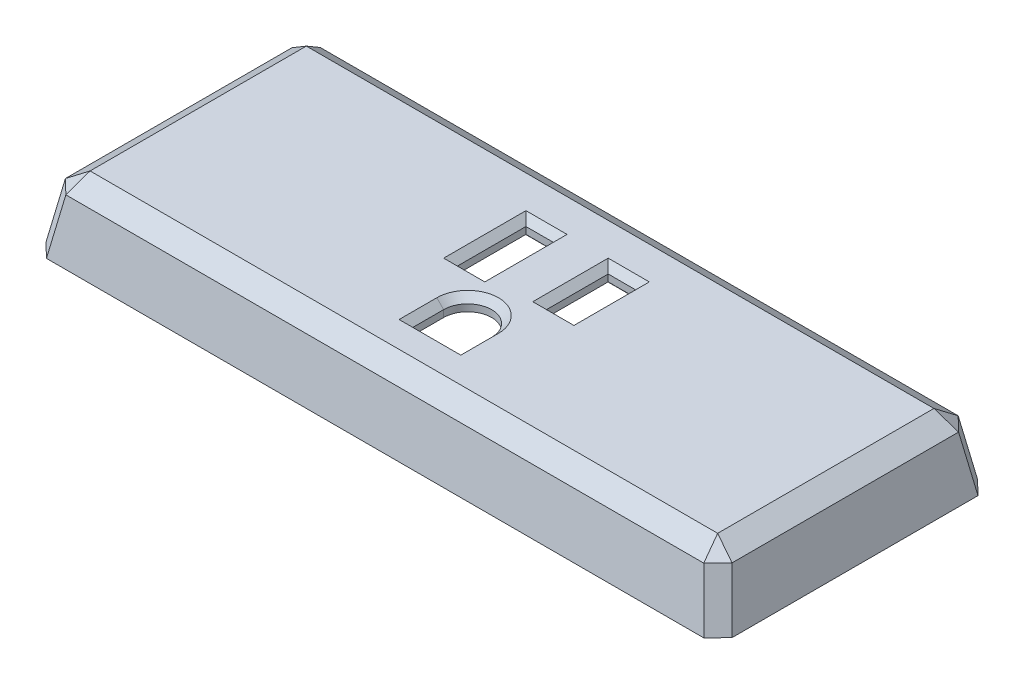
ISO-10303-21;
HEADER;
FILE_DESCRIPTION(('STEP AP214'),'2;1');
FILE_NAME('part.step','',(''),(''),'','','');
FILE_SCHEMA(('AUTOMOTIVE_DESIGN { 1 0 10303 214 1 1 1 1 }'));
ENDSEC;
DATA;
#1=APPLICATION_CONTEXT('core data for automotive mechanical design processes');
#2=APPLICATION_PROTOCOL_DEFINITION('international standard','automotive_design',2000,#1);
#3=PRODUCT_CONTEXT('',#1,'mechanical');
#4=PRODUCT('Part','Part','',(#3));
#5=PRODUCT_RELATED_PRODUCT_CATEGORY('part','',(#4));
#6=PRODUCT_DEFINITION_FORMATION('','',#4);
#7=PRODUCT_DEFINITION_CONTEXT('part definition',#1,'design');
#8=PRODUCT_DEFINITION('design','',#6,#7);
#9=PRODUCT_DEFINITION_SHAPE('','',#8);
#10=(LENGTH_UNIT() NAMED_UNIT(*) SI_UNIT(.MILLI.,.METRE.));
#11=(NAMED_UNIT(*) PLANE_ANGLE_UNIT() SI_UNIT($,.RADIAN.));
#12=(NAMED_UNIT(*) SI_UNIT($,.STERADIAN.) SOLID_ANGLE_UNIT());
#13=UNCERTAINTY_MEASURE_WITH_UNIT(LENGTH_MEASURE(1.E-05),#10,'distance_accuracy_value','');
#14=(GEOMETRIC_REPRESENTATION_CONTEXT(3) GLOBAL_UNCERTAINTY_ASSIGNED_CONTEXT((#13)) GLOBAL_UNIT_ASSIGNED_CONTEXT((#10,
#11,#12)) REPRESENTATION_CONTEXT('',''));
#15=CARTESIAN_POINT('',(0.,0.,0.));
#16=DIRECTION('',(0.,0.,1.));
#17=DIRECTION('',(1.,0.,0.));
#18=AXIS2_PLACEMENT_3D('',#15,#16,#17);
#19=CARTESIAN_POINT('',(-50.,0.,-20.));
#20=DIRECTION('',(0.,-1.,0.));
#21=DIRECTION('',(0.,0.,-1.));
#22=AXIS2_PLACEMENT_3D('',#19,#20,#21);
#23=PLANE('',#22);
#24=DIRECTION('',(0.,0.,1.));
#25=VECTOR('',#24,1.);
#26=CARTESIAN_POINT('',(-50.,0.,20.));
#27=LINE('',#26,#25);
#28=CARTESIAN_POINT('',(-50.,0.,-17.9059754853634));
#29=VERTEX_POINT('',#28);
#30=CARTESIAN_POINT('',(-50.,0.,17.9700702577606));
#31=VERTEX_POINT('',#30);
#32=EDGE_CURVE('E589',#29,#31,#27,.T.);
#33=ORIENTED_EDGE('',*,*,#32,.F.);
#34=DIRECTION('',(-0.696032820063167,0.,0.718009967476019));
#35=VECTOR('',#34,1.);
#36=CARTESIAN_POINT('',(-48.9534934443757,0.,-18.9855253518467));
#37=LINE('',#36,#35);
#38=CARTESIAN_POINT('',(-47.9700702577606,0.,-20.));
#39=VERTEX_POINT('',#38);
#40=EDGE_CURVE('E642',#29,#39,#37,.F.);
#41=ORIENTED_EDGE('',*,*,#40,.T.);
#42=DIRECTION('',(-1.,0.,0.));
#43=VECTOR('',#42,1.);
#44=CARTESIAN_POINT('',(-50.,0.,-20.));
#45=LINE('',#44,#43);
#46=CARTESIAN_POINT('',(47.9059754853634,0.,-20.));
#47=VERTEX_POINT('',#46);
#48=EDGE_CURVE('E599',#47,#39,#45,.T.);
#49=ORIENTED_EDGE('',*,*,#48,.F.);
#50=DIRECTION('',(-0.718009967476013,0.,-0.696032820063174));
#51=VECTOR('',#50,1.);
#52=CARTESIAN_POINT('',(-2.56830598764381,0.,-68.9293436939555));
#53=LINE('',#52,#51);
#54=CARTESIAN_POINT('',(50.,0.,-17.9700702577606));
#55=VERTEX_POINT('',#54);
#56=EDGE_CURVE('E640',#47,#55,#53,.F.);
#57=ORIENTED_EDGE('',*,*,#56,.T.);
#58=DIRECTION('',(0.,0.,-1.));
#59=VECTOR('',#58,1.);
#60=CARTESIAN_POINT('',(50.,0.,20.));
#61=LINE('',#60,#59);
#62=CARTESIAN_POINT('',(50.,0.,17.9059754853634));
#63=VERTEX_POINT('',#62);
#64=EDGE_CURVE('E596',#63,#55,#61,.T.);
#65=ORIENTED_EDGE('',*,*,#64,.F.);
#66=DIRECTION('',(0.69603282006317,0.,-0.718009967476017));
#67=VECTOR('',#66,1.);
#68=CARTESIAN_POINT('',(20.4976648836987,0.,48.33984306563));
#69=LINE('',#68,#67);
#70=CARTESIAN_POINT('',(47.9700702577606,0.,20.));
#71=VERTEX_POINT('',#70);
#72=EDGE_CURVE('E638',#63,#71,#69,.F.);
#73=ORIENTED_EDGE('',*,*,#72,.T.);
#74=DIRECTION('',(1.,0.,0.));
#75=VECTOR('',#74,1.);
#76=CARTESIAN_POINT('',(-50.,0.,20.));
#77=LINE('',#76,#75);
#78=CARTESIAN_POINT('',(-47.9059754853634,0.,20.));
#79=VERTEX_POINT('',#78);
#80=EDGE_CURVE('E592',#79,#71,#77,.T.);
#81=ORIENTED_EDGE('',*,*,#80,.F.);
#82=DIRECTION('',(0.718009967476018,0.,0.696032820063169));
#83=VECTOR('',#82,1.);
#84=CARTESIAN_POINT('',(-68.9758654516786,0.,-0.424974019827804));
#85=LINE('',#84,#83);
#86=EDGE_CURVE('E636',#79,#31,#85,.F.);
#87=ORIENTED_EDGE('',*,*,#86,.T.);
#88=EDGE_LOOP('',(#33,#41,#49,#57,#65,#73,#81,#87));
#89=FACE_BOUND('',#88,.T.);
#90=DIRECTION('',(-0.696032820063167,0.,0.718009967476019));
#91=VECTOR('',#90,1.);
#92=CARTESIAN_POINT('',(-47.4735096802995,0.,-17.5508415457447));
#93=LINE('',#92,#91);
#94=CARTESIAN_POINT('',(-47.9691467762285,0.,-17.0395547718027));
#95=VERTEX_POINT('',#94);
#96=CARTESIAN_POINT('',(-47.0680081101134,0.,-17.9691467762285));
#97=VERTEX_POINT('',#96);
#98=EDGE_CURVE('E456',#95,#97,#93,.F.);
#99=ORIENTED_EDGE('',*,*,#98,.F.);
#100=DIRECTION('',(0.,0.,-1.));
#101=VECTOR('',#100,1.);
#102=CARTESIAN_POINT('',(-47.9691467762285,0.,-20.));
#103=LINE('',#102,#101);
#104=CARTESIAN_POINT('',(-47.9691467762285,0.,17.0680081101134));
#105=VERTEX_POINT('',#104);
#106=EDGE_CURVE('E466',#95,#105,#103,.F.);
#107=ORIENTED_EDGE('',*,*,#106,.T.);
#108=DIRECTION('',(0.718009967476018,0.,0.696032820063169));
#109=VECTOR('',#108,1.);
#110=CARTESIAN_POINT('',(-67.5411816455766,0.,-1.90495778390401));
#111=LINE('',#110,#109);
#112=CARTESIAN_POINT('',(-47.0395547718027,0.,17.9691467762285));
#113=VERTEX_POINT('',#112);
#114=EDGE_CURVE('E481',#113,#105,#111,.F.);
#115=ORIENTED_EDGE('',*,*,#114,.F.);
#116=DIRECTION('',(-1.,0.,0.));
#117=VECTOR('',#116,1.);
#118=CARTESIAN_POINT('',(-50.,0.,17.9691467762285));
#119=LINE('',#118,#117);
#120=CARTESIAN_POINT('',(47.0680081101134,0.,17.9691467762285));
#121=VERTEX_POINT('',#120);
#122=EDGE_CURVE('E469',#113,#121,#119,.F.);
#123=ORIENTED_EDGE('',*,*,#122,.T.);
#124=DIRECTION('',(0.69603282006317,0.,-0.718009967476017));
#125=VECTOR('',#124,1.);
#126=CARTESIAN_POINT('',(19.0176811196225,0.,46.905159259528));
#127=LINE('',#126,#125);
#128=CARTESIAN_POINT('',(47.9691467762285,0.,17.0395547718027));
#129=VERTEX_POINT('',#128);
#130=EDGE_CURVE('E477',#129,#121,#127,.F.);
#131=ORIENTED_EDGE('',*,*,#130,.F.);
#132=DIRECTION('',(0.,0.,1.));
#133=VECTOR('',#132,1.);
#134=CARTESIAN_POINT('',(47.9691467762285,0.,-20.));
#135=LINE('',#134,#133);
#136=CARTESIAN_POINT('',(47.9691467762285,0.,-17.0680081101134));
#137=VERTEX_POINT('',#136);
#138=EDGE_CURVE('E475',#129,#137,#135,.F.);
#139=ORIENTED_EDGE('',*,*,#138,.T.);
#140=DIRECTION('',(-0.718009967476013,0.,-0.696032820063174));
#141=VECTOR('',#140,1.);
#142=CARTESIAN_POINT('',(-4.00298979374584,0.,-67.4493599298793));
#143=LINE('',#142,#141);
#144=CARTESIAN_POINT('',(47.0395547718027,0.,-17.9691467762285));
#145=VERTEX_POINT('',#144);
#146=EDGE_CURVE('E472',#145,#137,#143,.F.);
#147=ORIENTED_EDGE('',*,*,#146,.F.);
#148=DIRECTION('',(1.,0.,0.));
#149=VECTOR('',#148,1.);
#150=CARTESIAN_POINT('',(-50.,0.,-17.9691467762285));
#151=LINE('',#150,#149);
#152=EDGE_CURVE('E449',#145,#97,#151,.F.);
#153=ORIENTED_EDGE('',*,*,#152,.T.);
#154=EDGE_LOOP('',(#99,#107,#115,#123,#131,#139,#147,#153));
#155=FACE_BOUND('',#154,.T.);
#156=ADVANCED_FACE('F32',(#89,#155),#23,.T.);
#157=CARTESIAN_POINT('',(-50.,0.,20.));
#158=DIRECTION('',(-0.984807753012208,0.173648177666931,0.));
#159=DIRECTION('',(-0.173648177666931,-0.984807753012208,0.));
#160=AXIS2_PLACEMENT_3D('',#157,#158,#159);
#161=PLANE('',#160);
#162=DIRECTION('',(0.,0.,1.));
#163=VECTOR('',#162,1.);
#164=CARTESIAN_POINT('',(-48.5840265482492,8.03038449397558,20.));
#165=LINE('',#164,#163);
#166=CARTESIAN_POINT('',(-48.5840265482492,8.03038449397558,16.5540968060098));
#167=VERTEX_POINT('',#166);
#168=CARTESIAN_POINT('',(-48.5840265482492,8.03038449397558,-16.4900020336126));
#169=VERTEX_POINT('',#168);
#170=EDGE_CURVE('E632',#167,#169,#165,.F.);
#171=ORIENTED_EDGE('',*,*,#170,.T.);
#172=DIRECTION('',(0.171087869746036,0.970287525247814,0.171087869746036));
#173=VECTOR('',#172,1.);
#174=CARTESIAN_POINT('',(-48.8904519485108,6.29255969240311,-16.7964274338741));
#175=LINE('',#174,#173);
#176=EDGE_CURVE('E634',#169,#29,#175,.F.);
#177=ORIENTED_EDGE('',*,*,#176,.T.);
#178=ORIENTED_EDGE('',*,*,#32,.T.);
#179=DIRECTION('',(-0.171087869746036,-0.970287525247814,0.171087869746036));
#180=VECTOR('',#179,1.);
#181=CARTESIAN_POINT('',(-50.0594181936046,-0.336977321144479,18.0294884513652));
#182=LINE('',#181,#180);
#183=EDGE_CURVE('E630',#31,#167,#182,.F.);
#184=ORIENTED_EDGE('',*,*,#183,.T.);
#185=EDGE_LOOP('',(#171,#177,#178,#184));
#186=FACE_BOUND('',#185,.T.);
#187=ADVANCED_FACE('F758',(#186),#161,.T.);
#188=CARTESIAN_POINT('',(-50.,0.,20.));
#189=DIRECTION('',(0.,0.173648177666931,0.984807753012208));
#190=DIRECTION('',(0.,-0.984807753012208,0.173648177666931));
#191=AXIS2_PLACEMENT_3D('',#188,#189,#190);
#192=PLANE('',#191);
#193=ORIENTED_EDGE('',*,*,#80,.T.);
#194=DIRECTION('',(0.171087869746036,-0.970287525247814,0.171087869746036));
#195=VECTOR('',#194,1.);
#196=CARTESIAN_POINT('',(45.1023825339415,16.2634652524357,17.132312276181));
#197=LINE('',#196,#195);
#198=CARTESIAN_POINT('',(46.5540968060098,8.03038449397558,18.5840265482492));
#199=VERTEX_POINT('',#198);
#200=EDGE_CURVE('E628',#71,#199,#197,.F.);
#201=ORIENTED_EDGE('',*,*,#200,.T.);
#202=DIRECTION('',(1.,0.,0.));
#203=VECTOR('',#202,1.);
#204=CARTESIAN_POINT('',(-50.,8.03038449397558,18.5840265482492));
#205=LINE('',#204,#203);
#206=CARTESIAN_POINT('',(-46.4900020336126,8.03038449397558,18.5840265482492));
#207=VERTEX_POINT('',#206);
#208=EDGE_CURVE('E626',#199,#207,#205,.F.);
#209=ORIENTED_EDGE('',*,*,#208,.T.);
#210=DIRECTION('',(0.171087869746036,0.970287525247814,-0.171087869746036));
#211=VECTOR('',#210,1.);
#212=CARTESIAN_POINT('',(-47.9672698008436,-0.347617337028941,20.0612943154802));
#213=LINE('',#212,#211);
#214=EDGE_CURVE('E624',#207,#79,#213,.F.);
#215=ORIENTED_EDGE('',*,*,#214,.T.);
#216=EDGE_LOOP('',(#193,#201,#209,#215));
#217=FACE_BOUND('',#216,.T.);
#218=ADVANCED_FACE('F764',(#217),#192,.T.);
#219=CARTESIAN_POINT('',(50.,0.,20.));
#220=DIRECTION('',(0.984807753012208,0.173648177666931,0.));
#221=DIRECTION('',(-0.173648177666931,0.984807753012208,0.));
#222=AXIS2_PLACEMENT_3D('',#219,#220,#221);
#223=PLANE('',#222);
#224=ORIENTED_EDGE('',*,*,#64,.T.);
#225=DIRECTION('',(0.171087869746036,-0.970287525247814,-0.171087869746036));
#226=VECTOR('',#225,1.);
#227=CARTESIAN_POINT('',(48.8885758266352,6.30319970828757,-16.8586460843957));
#228=LINE('',#227,#226);
#229=CARTESIAN_POINT('',(48.5840265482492,8.03038449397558,-16.5540968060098));
#230=VERTEX_POINT('',#229);
#231=EDGE_CURVE('E622',#55,#230,#228,.F.);
#232=ORIENTED_EDGE('',*,*,#231,.T.);
#233=DIRECTION('',(0.,0.,-1.));
#234=VECTOR('',#233,1.);
#235=CARTESIAN_POINT('',(48.5840265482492,8.03038449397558,20.));
#236=LINE('',#235,#234);
#237=CARTESIAN_POINT('',(48.5840265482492,8.03038449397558,16.4900020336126));
#238=VERTEX_POINT('',#237);
#239=EDGE_CURVE('E620',#230,#238,#236,.F.);
#240=ORIENTED_EDGE('',*,*,#239,.T.);
#241=DIRECTION('',(-0.171087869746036,0.970287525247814,-0.171087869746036));
#242=VECTOR('',#241,1.);
#243=CARTESIAN_POINT('',(50.0612943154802,-0.347617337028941,17.9672698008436));
#244=LINE('',#243,#242);
#245=EDGE_CURVE('E618',#238,#63,#244,.F.);
#246=ORIENTED_EDGE('',*,*,#245,.T.);
#247=EDGE_LOOP('',(#224,#232,#240,#246));
#248=FACE_BOUND('',#247,.T.);
#249=ADVANCED_FACE('F775',(#248),#223,.T.);
#250=CARTESIAN_POINT('',(-50.,0.,-20.));
#251=DIRECTION('',(0.,0.173648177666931,-0.984807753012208));
#252=DIRECTION('',(0.,0.984807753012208,0.173648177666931));
#253=AXIS2_PLACEMENT_3D('',#250,#251,#252);
#254=PLANE('',#253);
#255=ORIENTED_EDGE('',*,*,#48,.T.);
#256=DIRECTION('',(-0.171087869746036,-0.970287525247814,-0.171087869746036));
#257=VECTOR('',#256,1.);
#258=CARTESIAN_POINT('',(-48.0294884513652,-0.336977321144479,-20.0594181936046));
#259=LINE('',#258,#257);
#260=CARTESIAN_POINT('',(-46.5540968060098,8.03038449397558,-18.5840265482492));
#261=VERTEX_POINT('',#260);
#262=EDGE_CURVE('E616',#39,#261,#259,.F.);
#263=ORIENTED_EDGE('',*,*,#262,.T.);
#264=DIRECTION('',(-1.,0.,0.));
#265=VECTOR('',#264,1.);
#266=CARTESIAN_POINT('',(-50.,8.03038449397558,-18.5840265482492));
#267=LINE('',#266,#265);
#268=CARTESIAN_POINT('',(46.4900020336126,8.03038449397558,-18.5840265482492));
#269=VERTEX_POINT('',#268);
#270=EDGE_CURVE('E613',#261,#269,#267,.F.);
#271=ORIENTED_EDGE('',*,*,#270,.T.);
#272=DIRECTION('',(-0.171087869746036,0.970287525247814,0.171087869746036));
#273=VECTOR('',#272,1.);
#274=CARTESIAN_POINT('',(45.04016388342,16.2528252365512,-17.1341883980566));
#275=LINE('',#274,#273);
#276=EDGE_CURVE('E611',#269,#47,#275,.F.);
#277=ORIENTED_EDGE('',*,*,#276,.T.);
#278=EDGE_LOOP('',(#255,#263,#271,#277));
#279=FACE_BOUND('',#278,.T.);
#280=ADVANCED_FACE('F772',(#279),#254,.T.);
#281=CARTESIAN_POINT('',(-50.,10.,-20.));
#282=DIRECTION('',(0.,-1.,0.));
#283=DIRECTION('',(0.,0.,-1.));
#284=AXIS2_PLACEMENT_3D('',#281,#282,#283);
#285=PLANE('',#284);
#286=DIRECTION('',(-1.,0.,0.));
#287=VECTOR('',#286,1.);
#288=CARTESIAN_POINT('',(-50.,10.,12.0000000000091));
#289=LINE('',#288,#287);
#290=CARTESIAN_POINT('',(4.53204738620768,10.,12.0000000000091));
#291=VERTEX_POINT('',#290);
#292=CARTESIAN_POINT('',(-4.46795261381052,10.,12.0000000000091));
#293=VERTEX_POINT('',#292);
#294=EDGE_CURVE('E348',#291,#293,#289,.T.);
#295=ORIENTED_EDGE('',*,*,#294,.T.);
#296=DIRECTION('',(0.,0.,-1.));
#297=VECTOR('',#296,1.);
#298=CARTESIAN_POINT('',(-4.46795261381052,10.,-20.));
#299=LINE('',#298,#297);
#300=CARTESIAN_POINT('',(-4.46795261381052,10.,6.49999999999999));
#301=VERTEX_POINT('',#300);
#302=EDGE_CURVE('E350',#293,#301,#299,.T.);
#303=ORIENTED_EDGE('',*,*,#302,.T.);
#304=CARTESIAN_POINT('',(0.0320473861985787,10.,6.49999999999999));
#305=DIRECTION('',(0.,-1.,0.));
#306=DIRECTION('',(0.,0.,-1.));
#307=AXIS2_PLACEMENT_3D('',#304,#305,#306);
#308=CIRCLE('',#307,4.5000000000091);
#309=CARTESIAN_POINT('',(4.53204738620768,10.,6.49999999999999));
#310=VERTEX_POINT('',#309);
#311=EDGE_CURVE('E344',#301,#310,#308,.T.);
#312=ORIENTED_EDGE('',*,*,#311,.T.);
#313=DIRECTION('',(0.,0.,1.));
#314=VECTOR('',#313,1.);
#315=CARTESIAN_POINT('',(4.53204738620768,10.,-20.));
#316=LINE('',#315,#314);
#317=EDGE_CURVE('E346',#310,#291,#316,.T.);
#318=ORIENTED_EDGE('',*,*,#317,.T.);
#319=EDGE_LOOP('',(#295,#303,#312,#318));
#320=FACE_BOUND('',#319,.T.);
#321=DIRECTION('',(1.,0.,0.));
#322=VECTOR('',#321,1.);
#323=CARTESIAN_POINT('',(-50.,10.,-11.0000000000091));
#324=LINE('',#323,#322);
#325=CARTESIAN_POINT('',(3.03204738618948,10.,-11.0000000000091));
#326=VERTEX_POINT('',#325);
#327=CARTESIAN_POINT('',(9.03204738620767,10.,-11.0000000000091));
#328=VERTEX_POINT('',#327);
#329=EDGE_CURVE('E339',#326,#328,#324,.T.);
#330=ORIENTED_EDGE('',*,*,#329,.T.);
#331=DIRECTION('',(0.,0.,1.));
#332=VECTOR('',#331,1.);
#333=CARTESIAN_POINT('',(9.03204738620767,10.,-20.));
#334=LINE('',#333,#332);
#335=CARTESIAN_POINT('',(9.03204738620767,10.,9.08995101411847E-12));
#336=VERTEX_POINT('',#335);
#337=EDGE_CURVE('E341',#328,#336,#334,.T.);
#338=ORIENTED_EDGE('',*,*,#337,.T.);
#339=DIRECTION('',(-1.,0.,0.));
#340=VECTOR('',#339,1.);
#341=CARTESIAN_POINT('',(-50.,10.,9.08995101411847E-12));
#342=LINE('',#341,#340);
#343=CARTESIAN_POINT('',(3.03204738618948,10.,9.08995101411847E-12));
#344=VERTEX_POINT('',#343);
#345=EDGE_CURVE('E335',#336,#344,#342,.T.);
#346=ORIENTED_EDGE('',*,*,#345,.T.);
#347=DIRECTION('',(0.,0.,-1.));
#348=VECTOR('',#347,1.);
#349=CARTESIAN_POINT('',(3.03204738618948,10.,-20.));
#350=LINE('',#349,#348);
#351=EDGE_CURVE('E337',#344,#326,#350,.T.);
#352=ORIENTED_EDGE('',*,*,#351,.T.);
#353=EDGE_LOOP('',(#330,#338,#346,#352));
#354=FACE_BOUND('',#353,.T.);
#355=DIRECTION('',(1.,0.,0.));
#356=VECTOR('',#355,1.);
#357=CARTESIAN_POINT('',(-50.,10.,-11.0000000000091));
#358=LINE('',#357,#356);
#359=CARTESIAN_POINT('',(-8.96795261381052,10.,-11.0000000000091));
#360=VERTEX_POINT('',#359);
#361=CARTESIAN_POINT('',(-2.96795261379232,10.,-11.0000000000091));
#362=VERTEX_POINT('',#361);
#363=EDGE_CURVE('E330',#360,#362,#358,.T.);
#364=ORIENTED_EDGE('',*,*,#363,.T.);
#365=DIRECTION('',(0.,0.,1.));
#366=VECTOR('',#365,1.);
#367=CARTESIAN_POINT('',(-2.96795261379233,10.,-20.));
#368=LINE('',#367,#366);
#369=CARTESIAN_POINT('',(-2.96795261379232,10.,1.00000000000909));
#370=VERTEX_POINT('',#369);
#371=EDGE_CURVE('E332',#362,#370,#368,.T.);
#372=ORIENTED_EDGE('',*,*,#371,.T.);
#373=DIRECTION('',(-1.,0.,0.));
#374=VECTOR('',#373,1.);
#375=CARTESIAN_POINT('',(-50.,10.,1.00000000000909));
#376=LINE('',#375,#374);
#377=CARTESIAN_POINT('',(-8.96795261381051,10.,1.00000000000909));
#378=VERTEX_POINT('',#377);
#379=EDGE_CURVE('E322',#370,#378,#376,.T.);
#380=ORIENTED_EDGE('',*,*,#379,.T.);
#381=DIRECTION('',(0.,0.,-1.));
#382=VECTOR('',#381,1.);
#383=CARTESIAN_POINT('',(-8.96795261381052,10.,-20.));
#384=LINE('',#383,#382);
#385=EDGE_CURVE('E328',#378,#360,#384,.T.);
#386=ORIENTED_EDGE('',*,*,#385,.T.);
#387=EDGE_LOOP('',(#364,#372,#380,#386));
#388=FACE_BOUND('',#387,.T.);
#389=DIRECTION('',(0.,0.,-1.));
#390=VECTOR('',#389,1.);
#391=CARTESIAN_POINT('',(45.7711240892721,10.,-20.));
#392=LINE('',#391,#390);
#393=CARTESIAN_POINT('',(45.7711240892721,10.,15.7711240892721));
#394=VERTEX_POINT('',#393);
#395=CARTESIAN_POINT('',(45.7711240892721,10.,-15.7711240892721));
#396=VERTEX_POINT('',#395);
#397=EDGE_CURVE('E606',#394,#396,#392,.T.);
#398=ORIENTED_EDGE('',*,*,#397,.T.);
#399=DIRECTION('',(-1.,0.,0.));
#400=VECTOR('',#399,1.);
#401=CARTESIAN_POINT('',(-50.,10.,-15.7711240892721));
#402=LINE('',#401,#400);
#403=CARTESIAN_POINT('',(-45.7711240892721,10.,-15.7711240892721));
#404=VERTEX_POINT('',#403);
#405=EDGE_CURVE('E608',#396,#404,#402,.T.);
#406=ORIENTED_EDGE('',*,*,#405,.T.);
#407=DIRECTION('',(0.,0.,1.));
#408=VECTOR('',#407,1.);
#409=CARTESIAN_POINT('',(-45.7711240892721,10.,-20.));
#410=LINE('',#409,#408);
#411=CARTESIAN_POINT('',(-45.7711240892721,10.,15.7711240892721));
#412=VERTEX_POINT('',#411);
#413=EDGE_CURVE('E602',#404,#412,#410,.T.);
#414=ORIENTED_EDGE('',*,*,#413,.T.);
#415=DIRECTION('',(1.,0.,0.));
#416=VECTOR('',#415,1.);
#417=CARTESIAN_POINT('',(-50.,10.,15.7711240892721));
#418=LINE('',#417,#416);
#419=EDGE_CURVE('E604',#412,#394,#418,.T.);
#420=ORIENTED_EDGE('',*,*,#419,.T.);
#421=EDGE_LOOP('',(#398,#406,#414,#420));
#422=FACE_BOUND('',#421,.T.);
#423=ADVANCED_FACE('F409',(#320,#354,#388,#422),#285,.F.);
#424=CARTESIAN_POINT('',(50.0612943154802,-0.347617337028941,17.9672698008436));
#425=DIRECTION('',(-0.696681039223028,-0.241927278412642,-0.675356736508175));
#426=DIRECTION('',(-0.69603282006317,0.,0.718009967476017));
#427=AXIS2_PLACEMENT_3D('',#424,#425,#426);
#428=PLANE('',#427);
#429=ORIENTED_EDGE('',*,*,#72,.F.);
#430=ORIENTED_EDGE('',*,*,#245,.F.);
#431=DIRECTION('',(-0.69603282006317,0.,0.718009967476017));
#432=VECTOR('',#431,1.);
#433=CARTESIAN_POINT('',(48.5840265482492,8.03038449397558,16.4900020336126));
#434=LINE('',#433,#432);
#435=EDGE_CURVE('E593',#199,#238,#434,.F.);
#436=ORIENTED_EDGE('',*,*,#435,.F.);
#437=ORIENTED_EDGE('',*,*,#200,.F.);
#438=EDGE_LOOP('',(#429,#430,#436,#437));
#439=FACE_BOUND('',#438,.T.);
#440=ADVANCED_FACE('F827',(#439),#428,.F.);
#441=CARTESIAN_POINT('',(-50.,10.,15.7711240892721));
#442=DIRECTION('',(0.,0.819152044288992,0.573576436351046));
#443=DIRECTION('',(0.,-0.573576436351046,0.819152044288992));
#444=AXIS2_PLACEMENT_3D('',#441,#442,#443);
#445=PLANE('',#444);
#446=DIRECTION('',(0.204904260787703,0.561406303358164,-0.80177129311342));
#447=VECTOR('',#446,1.);
#448=CARTESIAN_POINT('',(-46.4900020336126,8.03038449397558,18.5840265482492));
#449=LINE('',#448,#447);
#450=EDGE_CURVE('E669',#207,#412,#449,.T.);
#451=ORIENTED_EDGE('',*,*,#450,.F.);
#452=ORIENTED_EDGE('',*,*,#208,.F.);
#453=DIRECTION('',(0.222305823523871,-0.559223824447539,0.798654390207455));
#454=VECTOR('',#453,1.);
#455=CARTESIAN_POINT('',(46.2826310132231,8.71327321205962,17.6087603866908));
#456=LINE('',#455,#454);
#457=EDGE_CURVE('E672',#394,#199,#456,.T.);
#458=ORIENTED_EDGE('',*,*,#457,.F.);
#459=ORIENTED_EDGE('',*,*,#419,.F.);
#460=EDGE_LOOP('',(#451,#452,#458,#459));
#461=FACE_BOUND('',#460,.T.);
#462=ADVANCED_FACE('F823',(#461),#445,.T.);
#463=CARTESIAN_POINT('',(-47.9672698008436,-0.347617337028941,20.0612943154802));
#464=DIRECTION('',(0.675356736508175,-0.241927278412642,-0.696681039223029));
#465=DIRECTION('',(-0.718009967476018,0.,-0.696032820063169));
#466=AXIS2_PLACEMENT_3D('',#463,#464,#465);
#467=PLANE('',#466);
#468=ORIENTED_EDGE('',*,*,#86,.F.);
#469=ORIENTED_EDGE('',*,*,#214,.F.);
#470=DIRECTION('',(-0.718009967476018,0.,-0.696032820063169));
#471=VECTOR('',#470,1.);
#472=CARTESIAN_POINT('',(-46.4900020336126,8.03038449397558,18.5840265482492));
#473=LINE('',#472,#471);
#474=EDGE_CURVE('E666',#167,#207,#473,.F.);
#475=ORIENTED_EDGE('',*,*,#474,.F.);
#476=ORIENTED_EDGE('',*,*,#183,.F.);
#477=EDGE_LOOP('',(#468,#469,#475,#476));
#478=FACE_BOUND('',#477,.T.);
#479=ADVANCED_FACE('F819',(#478),#467,.F.);
#480=CARTESIAN_POINT('',(48.5840265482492,8.03038449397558,16.4900020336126));
#481=DIRECTION('',(0.442153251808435,0.787899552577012,0.42861964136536));
#482=DIRECTION('',(-0.872067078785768,0.489386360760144,0.));
#483=AXIS2_PLACEMENT_3D('',#480,#481,#482);
#484=PLANE('',#483);
#485=ORIENTED_EDGE('',*,*,#457,.T.);
#486=ORIENTED_EDGE('',*,*,#435,.T.);
#487=DIRECTION('',(-0.801771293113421,0.561406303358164,-0.204904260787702));
#488=VECTOR('',#487,1.);
#489=CARTESIAN_POINT('',(48.5840265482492,8.03038449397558,16.4900020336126));
#490=LINE('',#489,#488);
#491=EDGE_CURVE('E663',#394,#238,#490,.F.);
#492=ORIENTED_EDGE('',*,*,#491,.F.);
#493=EDGE_LOOP('',(#485,#486,#492));
#494=FACE_BOUND('',#493,.T.);
#495=ADVANCED_FACE('F815',(#494),#484,.T.);
#496=CARTESIAN_POINT('',(-46.4900020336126,8.03038449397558,18.5840265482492));
#497=DIRECTION('',(-0.428619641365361,0.787899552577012,0.442153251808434));
#498=DIRECTION('',(0.,-0.489386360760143,0.872067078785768));
#499=AXIS2_PLACEMENT_3D('',#496,#497,#498);
#500=PLANE('',#499);
#501=ORIENTED_EDGE('',*,*,#474,.T.);
#502=ORIENTED_EDGE('',*,*,#450,.T.);
#503=DIRECTION('',(-0.798654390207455,-0.559223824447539,0.22230582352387));
#504=VECTOR('',#503,1.);
#505=CARTESIAN_POINT('',(-47.6087603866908,8.71327321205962,16.2826310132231));
#506=LINE('',#505,#504);
#507=EDGE_CURVE('E660',#167,#412,#506,.F.);
#508=ORIENTED_EDGE('',*,*,#507,.F.);
#509=EDGE_LOOP('',(#501,#502,#508));
#510=FACE_BOUND('',#509,.T.);
#511=ADVANCED_FACE('F811',(#510),#500,.T.);
#512=CARTESIAN_POINT('',(45.04016388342,16.2528252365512,-17.1341883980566));
#513=DIRECTION('',(-0.67535673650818,-0.241927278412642,0.696681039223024));
#514=DIRECTION('',(0.718009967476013,0.,0.696032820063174));
#515=AXIS2_PLACEMENT_3D('',#512,#513,#514);
#516=PLANE('',#515);
#517=ORIENTED_EDGE('',*,*,#56,.F.);
#518=ORIENTED_EDGE('',*,*,#276,.F.);
#519=DIRECTION('',(0.718009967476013,0.,0.696032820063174));
#520=VECTOR('',#519,1.);
#521=CARTESIAN_POINT('',(46.4900020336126,8.03038449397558,-18.5840265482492));
#522=LINE('',#521,#520);
#523=EDGE_CURVE('E657',#230,#269,#522,.F.);
#524=ORIENTED_EDGE('',*,*,#523,.F.);
#525=ORIENTED_EDGE('',*,*,#231,.F.);
#526=EDGE_LOOP('',(#517,#518,#524,#525));
#527=FACE_BOUND('',#526,.T.);
#528=ADVANCED_FACE('F807',(#527),#516,.F.);
#529=CARTESIAN_POINT('',(45.7711240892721,10.,-20.));
#530=DIRECTION('',(0.573576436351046,0.819152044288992,0.));
#531=DIRECTION('',(-0.819152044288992,0.573576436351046,0.));
#532=AXIS2_PLACEMENT_3D('',#529,#530,#531);
#533=PLANE('',#532);
#534=ORIENTED_EDGE('',*,*,#491,.T.);
#535=ORIENTED_EDGE('',*,*,#239,.F.);
#536=DIRECTION('',(0.798654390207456,-0.55922382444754,-0.222305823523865));
#537=VECTOR('',#536,1.);
#538=CARTESIAN_POINT('',(47.6087603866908,8.71327321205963,-16.2826310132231));
#539=LINE('',#538,#537);
#540=EDGE_CURVE('E654',#396,#230,#539,.T.);
#541=ORIENTED_EDGE('',*,*,#540,.F.);
#542=ORIENTED_EDGE('',*,*,#397,.F.);
#543=EDGE_LOOP('',(#534,#535,#541,#542));
#544=FACE_BOUND('',#543,.T.);
#545=ADVANCED_FACE('F803',(#544),#533,.T.);
#546=CARTESIAN_POINT('',(-45.7711240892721,10.,-20.));
#547=DIRECTION('',(-0.573576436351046,0.819152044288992,0.));
#548=DIRECTION('',(-0.819152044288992,-0.573576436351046,0.));
#549=AXIS2_PLACEMENT_3D('',#546,#547,#548);
#550=PLANE('',#549);
#551=ORIENTED_EDGE('',*,*,#507,.T.);
#552=ORIENTED_EDGE('',*,*,#413,.F.);
#553=DIRECTION('',(0.801771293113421,0.561406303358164,0.2049042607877));
#554=VECTOR('',#553,1.);
#555=CARTESIAN_POINT('',(-45.7711240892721,10.,-15.7711240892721));
#556=LINE('',#555,#554);
#557=EDGE_CURVE('E651',#169,#404,#556,.T.);
#558=ORIENTED_EDGE('',*,*,#557,.F.);
#559=ORIENTED_EDGE('',*,*,#170,.F.);
#560=EDGE_LOOP('',(#551,#552,#558,#559));
#561=FACE_BOUND('',#560,.T.);
#562=ADVANCED_FACE('F799',(#561),#550,.T.);
#563=CARTESIAN_POINT('',(-48.8904519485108,6.29255969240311,-16.7964274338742));
#564=DIRECTION('',(0.696681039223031,-0.241927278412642,0.675356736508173));
#565=DIRECTION('',(0.696032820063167,0.,-0.718009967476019));
#566=AXIS2_PLACEMENT_3D('',#563,#564,#565);
#567=PLANE('',#566);
#568=ORIENTED_EDGE('',*,*,#40,.F.);
#569=ORIENTED_EDGE('',*,*,#176,.F.);
#570=DIRECTION('',(0.696032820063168,0.,-0.718009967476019));
#571=VECTOR('',#570,1.);
#572=CARTESIAN_POINT('',(-47.5805484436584,8.03038449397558,-17.5251648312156));
#573=LINE('',#572,#571);
#574=EDGE_CURVE('E648',#261,#169,#573,.F.);
#575=ORIENTED_EDGE('',*,*,#574,.F.);
#576=ORIENTED_EDGE('',*,*,#262,.F.);
#577=EDGE_LOOP('',(#568,#569,#575,#576));
#578=FACE_BOUND('',#577,.T.);
#579=ADVANCED_FACE('F795',(#578),#567,.F.);
#580=CARTESIAN_POINT('',(46.4900020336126,8.03038449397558,-18.5840265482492));
#581=DIRECTION('',(0.428619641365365,0.787899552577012,-0.442153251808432));
#582=DIRECTION('',(0.,0.489386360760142,0.872067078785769));
#583=AXIS2_PLACEMENT_3D('',#580,#581,#582);
#584=PLANE('',#583);
#585=ORIENTED_EDGE('',*,*,#540,.T.);
#586=ORIENTED_EDGE('',*,*,#523,.T.);
#587=DIRECTION('',(-0.204904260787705,0.561406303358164,0.80177129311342));
#588=VECTOR('',#587,1.);
#589=CARTESIAN_POINT('',(46.4900020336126,8.03038449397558,-18.5840265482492));
#590=LINE('',#589,#588);
#591=EDGE_CURVE('E646',#396,#269,#590,.F.);
#592=ORIENTED_EDGE('',*,*,#591,.F.);
#593=EDGE_LOOP('',(#585,#586,#592));
#594=FACE_BOUND('',#593,.T.);
#595=ADVANCED_FACE('F791',(#594),#584,.T.);
#596=CARTESIAN_POINT('',(-45.7711240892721,10.,-15.7711240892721));
#597=DIRECTION('',(-0.442153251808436,0.787899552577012,-0.42861964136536));
#598=DIRECTION('',(-0.872067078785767,-0.489386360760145,0.));
#599=AXIS2_PLACEMENT_3D('',#596,#597,#598);
#600=PLANE('',#599);
#601=ORIENTED_EDGE('',*,*,#574,.T.);
#602=ORIENTED_EDGE('',*,*,#557,.T.);
#603=DIRECTION('',(-0.222305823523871,-0.559223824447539,-0.798654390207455));
#604=VECTOR('',#603,1.);
#605=CARTESIAN_POINT('',(-45.7711240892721,10.,-15.7711240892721));
#606=LINE('',#605,#604);
#607=EDGE_CURVE('E465',#261,#404,#606,.F.);
#608=ORIENTED_EDGE('',*,*,#607,.F.);
#609=EDGE_LOOP('',(#601,#602,#608));
#610=FACE_BOUND('',#609,.T.);
#611=ADVANCED_FACE('F787',(#610),#600,.T.);
#612=CARTESIAN_POINT('',(-50.,10.,-15.7711240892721));
#613=DIRECTION('',(0.,0.819152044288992,-0.573576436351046));
#614=DIRECTION('',(0.,0.573576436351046,0.819152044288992));
#615=AXIS2_PLACEMENT_3D('',#612,#613,#614);
#616=PLANE('',#615);
#617=ORIENTED_EDGE('',*,*,#591,.T.);
#618=ORIENTED_EDGE('',*,*,#270,.F.);
#619=ORIENTED_EDGE('',*,*,#607,.T.);
#620=ORIENTED_EDGE('',*,*,#405,.F.);
#621=EDGE_LOOP('',(#617,#618,#619,#620));
#622=FACE_BOUND('',#621,.T.);
#623=ADVANCED_FACE('F783',(#622),#616,.T.);
#624=CARTESIAN_POINT('',(-48.0303844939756,-0.347296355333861,20.));
#625=DIRECTION('',(-0.984807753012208,0.173648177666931,0.));
#626=DIRECTION('',(-0.173648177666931,-0.984807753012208,0.));
#627=AXIS2_PLACEMENT_3D('',#624,#625,#626);
#628=PLANE('',#627);
#629=DIRECTION('',(0.,0.,1.));
#630=VECTOR('',#629,1.);
#631=CARTESIAN_POINT('',(-46.7582659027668,6.86724668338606,-20.));
#632=LINE('',#631,#630);
#633=CARTESIAN_POINT('',(-46.7502061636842,6.8729260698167,15.8619791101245));
#634=VERTEX_POINT('',#633);
#635=CARTESIAN_POINT('',(-46.7568937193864,6.87289017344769,-15.8356962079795));
#636=VERTEX_POINT('',#635);
#637=EDGE_CURVE('E486',#634,#636,#632,.F.);
#638=ORIENTED_EDGE('',*,*,#637,.F.);
#639=DIRECTION('',(0.171087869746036,0.970287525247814,-0.171087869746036));
#640=VECTOR('',#639,1.);
#641=CARTESIAN_POINT('',(-48.114414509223,-0.823854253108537,17.2132758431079));
#642=LINE('',#641,#640);
#643=EDGE_CURVE('E488',#105,#634,#642,.T.);
#644=ORIENTED_EDGE('',*,*,#643,.F.);
#645=ORIENTED_EDGE('',*,*,#106,.F.);
#646=DIRECTION('',(-0.171087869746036,-0.970287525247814,-0.171087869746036));
#647=VECTOR('',#646,1.);
#648=CARTESIAN_POINT('',(-46.9444050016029,5.81159939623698,-16.0148129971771));
#649=LINE('',#648,#647);
#650=EDGE_CURVE('E485',#636,#95,#649,.T.);
#651=ORIENTED_EDGE('',*,*,#650,.F.);
#652=EDGE_LOOP('',(#638,#644,#645,#651));
#653=FACE_BOUND('',#652,.T.);
#654=ADVANCED_FACE('F786',(#653),#628,.F.);
#655=CARTESIAN_POINT('',(-50.,-0.347296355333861,18.0303844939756));
#656=DIRECTION('',(0.,0.173648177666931,0.984807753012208));
#657=DIRECTION('',(0.,-0.984807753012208,0.173648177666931));
#658=AXIS2_PLACEMENT_3D('',#655,#656,#657);
#659=PLANE('',#658);
#660=ORIENTED_EDGE('',*,*,#122,.F.);
#661=DIRECTION('',(-0.171087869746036,-0.970287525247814,0.171087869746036));
#662=VECTOR('',#661,1.);
#663=CARTESIAN_POINT('',(-47.1856553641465,-0.828577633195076,18.1152473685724));
#664=LINE('',#663,#662);
#665=CARTESIAN_POINT('',(-45.8356962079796,6.87289017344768,16.7568937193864));
#666=VERTEX_POINT('',#665);
#667=EDGE_CURVE('E498',#666,#113,#664,.T.);
#668=ORIENTED_EDGE('',*,*,#667,.F.);
#669=DIRECTION('',(1.,0.,0.));
#670=VECTOR('',#669,1.);
#671=CARTESIAN_POINT('',(-50.,6.86724668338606,16.7582659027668));
#672=LINE('',#671,#670);
#673=CARTESIAN_POINT('',(45.8619791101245,6.8729260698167,16.7502061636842));
#674=VERTEX_POINT('',#673);
#675=EDGE_CURVE('E501',#674,#666,#672,.F.);
#676=ORIENTED_EDGE('',*,*,#675,.F.);
#677=DIRECTION('',(-0.171087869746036,0.970287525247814,-0.171087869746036));
#678=VECTOR('',#677,1.);
#679=CARTESIAN_POINT('',(47.2132758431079,-0.823854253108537,18.114414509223));
#680=LINE('',#679,#678);
#681=EDGE_CURVE('E495',#121,#674,#680,.T.);
#682=ORIENTED_EDGE('',*,*,#681,.F.);
#683=EDGE_LOOP('',(#660,#668,#676,#682));
#684=FACE_BOUND('',#683,.T.);
#685=ADVANCED_FACE('F1130',(#684),#659,.F.);
#686=CARTESIAN_POINT('',(48.0303844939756,-0.347296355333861,20.));
#687=DIRECTION('',(0.984807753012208,0.173648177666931,0.));
#688=DIRECTION('',(-0.173648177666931,0.984807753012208,0.));
#689=AXIS2_PLACEMENT_3D('',#686,#687,#688);
#690=PLANE('',#689);
#691=ORIENTED_EDGE('',*,*,#138,.F.);
#692=DIRECTION('',(0.171087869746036,-0.970287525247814,0.171087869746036));
#693=VECTOR('',#692,1.);
#694=CARTESIAN_POINT('',(48.1152473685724,-0.828577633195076,17.1856553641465));
#695=LINE('',#694,#693);
#696=CARTESIAN_POINT('',(46.7568937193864,6.87289017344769,15.8356962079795));
#697=VERTEX_POINT('',#696);
#698=EDGE_CURVE('E518',#697,#129,#695,.T.);
#699=ORIENTED_EDGE('',*,*,#698,.F.);
#700=DIRECTION('',(0.,0.,-1.));
#701=VECTOR('',#700,1.);
#702=CARTESIAN_POINT('',(46.7582659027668,6.86724668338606,-20.));
#703=LINE('',#702,#701);
#704=CARTESIAN_POINT('',(46.7502061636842,6.8729260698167,-15.8619791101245));
#705=VERTEX_POINT('',#704);
#706=EDGE_CURVE('E520',#705,#697,#703,.F.);
#707=ORIENTED_EDGE('',*,*,#706,.F.);
#708=DIRECTION('',(-0.171087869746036,0.970287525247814,0.171087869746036));
#709=VECTOR('',#708,1.);
#710=CARTESIAN_POINT('',(45.1873085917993,15.7765883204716,-14.2861699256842));
#711=LINE('',#710,#709);
#712=EDGE_CURVE('E502',#137,#705,#711,.T.);
#713=ORIENTED_EDGE('',*,*,#712,.F.);
#714=EDGE_LOOP('',(#691,#699,#707,#713));
#715=FACE_BOUND('',#714,.T.);
#716=ADVANCED_FACE('F1120',(#715),#690,.F.);
#717=CARTESIAN_POINT('',(-50.,-0.347296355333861,-18.0303844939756));
#718=DIRECTION('',(0.,0.173648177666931,-0.984807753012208));
#719=DIRECTION('',(0.,0.984807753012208,0.173648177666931));
#720=AXIS2_PLACEMENT_3D('',#717,#718,#719);
#721=PLANE('',#720);
#722=ORIENTED_EDGE('',*,*,#152,.F.);
#723=DIRECTION('',(0.171087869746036,-0.970287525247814,-0.171087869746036));
#724=VECTOR('',#723,1.);
#725=CARTESIAN_POINT('',(44.2585494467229,15.7718649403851,-15.1881414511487));
#726=LINE('',#725,#724);
#727=CARTESIAN_POINT('',(45.8356962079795,6.87289017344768,-16.7568937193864));
#728=VERTEX_POINT('',#727);
#729=EDGE_CURVE('E445',#728,#145,#726,.T.);
#730=ORIENTED_EDGE('',*,*,#729,.F.);
#731=DIRECTION('',(-1.,0.,0.));
#732=VECTOR('',#731,1.);
#733=CARTESIAN_POINT('',(-50.,6.86724668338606,-16.7582659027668));
#734=LINE('',#733,#732);
#735=CARTESIAN_POINT('',(-45.8619791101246,6.8729260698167,-16.7502061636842));
#736=VERTEX_POINT('',#735);
#737=EDGE_CURVE('E565',#736,#728,#734,.F.);
#738=ORIENTED_EDGE('',*,*,#737,.F.);
#739=DIRECTION('',(0.171087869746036,0.970287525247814,0.171087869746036));
#740=VECTOR('',#739,1.);
#741=CARTESIAN_POINT('',(-46.0424334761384,5.81632277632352,-16.9435721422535));
#742=LINE('',#741,#740);
#743=EDGE_CURVE('E521',#97,#736,#742,.T.);
#744=ORIENTED_EDGE('',*,*,#743,.F.);
#745=EDGE_LOOP('',(#722,#730,#738,#744));
#746=FACE_BOUND('',#745,.T.);
#747=ADVANCED_FACE('F996',(#746),#721,.F.);
#748=CARTESIAN_POINT('',(-50.,8.,-20.));
#749=DIRECTION('',(0.,-1.,0.));
#750=DIRECTION('',(0.,0.,-1.));
#751=AXIS2_PLACEMENT_3D('',#748,#749,#750);
#752=PLANE('',#751);
#753=DIRECTION('',(0.,0.,1.));
#754=VECTOR('',#753,1.);
#755=CARTESIAN_POINT('',(3.53204738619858,8.,-20.));
#756=LINE('',#755,#754);
#757=CARTESIAN_POINT('',(3.53204738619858,8.,6.49999999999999));
#758=VERTEX_POINT('',#757);
#759=CARTESIAN_POINT('',(3.53204738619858,8.,11.));
#760=VERTEX_POINT('',#759);
#761=EDGE_CURVE('E309',#758,#760,#756,.T.);
#762=ORIENTED_EDGE('',*,*,#761,.F.);
#763=CARTESIAN_POINT('',(0.0320473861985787,8.,6.49999999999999));
#764=DIRECTION('',(0.,-1.,0.));
#765=DIRECTION('',(0.,0.,-1.));
#766=AXIS2_PLACEMENT_3D('',#763,#764,#765);
#767=CIRCLE('',#766,3.5);
#768=CARTESIAN_POINT('',(-3.46795261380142,8.,6.49999999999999));
#769=VERTEX_POINT('',#768);
#770=EDGE_CURVE('E292',#769,#758,#767,.T.);
#771=ORIENTED_EDGE('',*,*,#770,.F.);
#772=DIRECTION('',(0.,0.,-1.));
#773=VECTOR('',#772,1.);
#774=CARTESIAN_POINT('',(-3.46795261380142,8.,-20.));
#775=LINE('',#774,#773);
#776=CARTESIAN_POINT('',(-3.46795261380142,8.,11.));
#777=VERTEX_POINT('',#776);
#778=EDGE_CURVE('E303',#777,#769,#775,.T.);
#779=ORIENTED_EDGE('',*,*,#778,.F.);
#780=DIRECTION('',(-1.,0.,0.));
#781=VECTOR('',#780,1.);
#782=CARTESIAN_POINT('',(-50.,8.,11.));
#783=LINE('',#782,#781);
#784=EDGE_CURVE('E318',#760,#777,#783,.T.);
#785=ORIENTED_EDGE('',*,*,#784,.F.);
#786=EDGE_LOOP('',(#762,#771,#779,#785));
#787=FACE_BOUND('',#786,.T.);
#788=DIRECTION('',(0.,0.,-1.));
#789=VECTOR('',#788,1.);
#790=CARTESIAN_POINT('',(4.03204738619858,8.,-20.));
#791=LINE('',#790,#789);
#792=CARTESIAN_POINT('',(4.03204738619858,8.,-1.00000000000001));
#793=VERTEX_POINT('',#792);
#794=CARTESIAN_POINT('',(4.03204738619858,8.,-10.));
#795=VERTEX_POINT('',#794);
#796=EDGE_CURVE('E304',#793,#795,#791,.T.);
#797=ORIENTED_EDGE('',*,*,#796,.F.);
#798=DIRECTION('',(-1.,0.,0.));
#799=VECTOR('',#798,1.);
#800=CARTESIAN_POINT('',(-50.,8.,-1.00000000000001));
#801=LINE('',#800,#799);
#802=CARTESIAN_POINT('',(8.03204738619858,8.,-1.00000000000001));
#803=VERTEX_POINT('',#802);
#804=EDGE_CURVE('E683',#803,#793,#801,.T.);
#805=ORIENTED_EDGE('',*,*,#804,.F.);
#806=DIRECTION('',(0.,0.,1.));
#807=VECTOR('',#806,1.);
#808=CARTESIAN_POINT('',(8.03204738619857,8.,-20.));
#809=LINE('',#808,#807);
#810=CARTESIAN_POINT('',(8.03204738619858,8.,-10.));
#811=VERTEX_POINT('',#810);
#812=EDGE_CURVE('E685',#811,#803,#809,.T.);
#813=ORIENTED_EDGE('',*,*,#812,.F.);
#814=DIRECTION('',(1.,0.,0.));
#815=VECTOR('',#814,1.);
#816=CARTESIAN_POINT('',(-50.,8.,-10.));
#817=LINE('',#816,#815);
#818=EDGE_CURVE('E688',#795,#811,#817,.T.);
#819=ORIENTED_EDGE('',*,*,#818,.F.);
#820=EDGE_LOOP('',(#797,#805,#813,#819));
#821=FACE_BOUND('',#820,.T.);
#822=DIRECTION('',(0.,0.,-1.));
#823=VECTOR('',#822,1.);
#824=CARTESIAN_POINT('',(-7.96795261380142,8.,-20.));
#825=LINE('',#824,#823);
#826=CARTESIAN_POINT('',(-7.96795261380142,8.,0.));
#827=VERTEX_POINT('',#826);
#828=CARTESIAN_POINT('',(-7.96795261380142,8.,-10.));
#829=VERTEX_POINT('',#828);
#830=EDGE_CURVE('E681',#827,#829,#825,.T.);
#831=ORIENTED_EDGE('',*,*,#830,.F.);
#832=DIRECTION('',(-1.,0.,0.));
#833=VECTOR('',#832,1.);
#834=CARTESIAN_POINT('',(-50.,8.,0.));
#835=LINE('',#834,#833);
#836=CARTESIAN_POINT('',(-3.96795261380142,8.,0.));
#837=VERTEX_POINT('',#836);
#838=EDGE_CURVE('E644',#837,#827,#835,.T.);
#839=ORIENTED_EDGE('',*,*,#838,.F.);
#840=DIRECTION('',(0.,0.,1.));
#841=VECTOR('',#840,1.);
#842=CARTESIAN_POINT('',(-3.96795261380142,8.,-20.));
#843=LINE('',#842,#841);
#844=CARTESIAN_POINT('',(-3.96795261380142,8.,-10.));
#845=VERTEX_POINT('',#844);
#846=EDGE_CURVE('E678',#845,#837,#843,.T.);
#847=ORIENTED_EDGE('',*,*,#846,.F.);
#848=DIRECTION('',(1.,0.,0.));
#849=VECTOR('',#848,1.);
#850=CARTESIAN_POINT('',(-50.,8.,-10.));
#851=LINE('',#850,#849);
#852=EDGE_CURVE('E427',#829,#845,#851,.T.);
#853=ORIENTED_EDGE('',*,*,#852,.F.);
#854=EDGE_LOOP('',(#831,#839,#847,#853));
#855=FACE_BOUND('',#854,.T.);
#856=DIRECTION('',(0.,0.,-1.));
#857=VECTOR('',#856,1.);
#858=CARTESIAN_POINT('',(45.1405265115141,8.,-20.));
#859=LINE('',#858,#857);
#860=CARTESIAN_POINT('',(45.1405265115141,8.,15.1405265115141));
#861=VERTEX_POINT('',#860);
#862=CARTESIAN_POINT('',(45.1405265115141,8.,-15.1405265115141));
#863=VERTEX_POINT('',#862);
#864=EDGE_CURVE('E438',#861,#863,#859,.T.);
#865=ORIENTED_EDGE('',*,*,#864,.F.);
#866=DIRECTION('',(1.,0.,0.));
#867=VECTOR('',#866,1.);
#868=CARTESIAN_POINT('',(-50.,8.,15.1405265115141));
#869=LINE('',#868,#867);
#870=CARTESIAN_POINT('',(-45.1405265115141,8.,15.1405265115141));
#871=VERTEX_POINT('',#870);
#872=EDGE_CURVE('E442',#871,#861,#869,.T.);
#873=ORIENTED_EDGE('',*,*,#872,.F.);
#874=DIRECTION('',(0.,0.,1.));
#875=VECTOR('',#874,1.);
#876=CARTESIAN_POINT('',(-45.1405265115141,8.,-20.));
#877=LINE('',#876,#875);
#878=CARTESIAN_POINT('',(-45.1405265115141,8.,-15.1405265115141));
#879=VERTEX_POINT('',#878);
#880=EDGE_CURVE('E446',#879,#871,#877,.T.);
#881=ORIENTED_EDGE('',*,*,#880,.F.);
#882=DIRECTION('',(-1.,0.,0.));
#883=VECTOR('',#882,1.);
#884=CARTESIAN_POINT('',(-50.,8.,-15.1405265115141));
#885=LINE('',#884,#883);
#886=EDGE_CURVE('E441',#863,#879,#885,.T.);
#887=ORIENTED_EDGE('',*,*,#886,.F.);
#888=EDGE_LOOP('',(#865,#873,#881,#887));
#889=FACE_BOUND('',#888,.T.);
#890=ADVANCED_FACE('F316',(#787,#821,#855,#889),#752,.T.);
#891=CARTESIAN_POINT('',(48.6679322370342,-0.831471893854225,16.6165563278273));
#892=DIRECTION('',(-0.696681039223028,-0.241927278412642,-0.675356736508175));
#893=DIRECTION('',(-0.69603282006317,0.,0.718009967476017));
#894=AXIS2_PLACEMENT_3D('',#891,#892,#893);
#895=PLANE('',#894);
#896=ORIENTED_EDGE('',*,*,#130,.T.);
#897=ORIENTED_EDGE('',*,*,#681,.T.);
#898=DIRECTION('',(-0.69603282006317,0.,0.718009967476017));
#899=VECTOR('',#898,1.);
#900=CARTESIAN_POINT('',(47.3102519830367,6.87853366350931,15.2552156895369));
#901=LINE('',#900,#899);
#902=EDGE_CURVE('E470',#674,#697,#901,.F.);
#903=ORIENTED_EDGE('',*,*,#902,.T.);
#904=ORIENTED_EDGE('',*,*,#698,.T.);
#905=EDGE_LOOP('',(#896,#897,#903,#904));
#906=FACE_BOUND('',#905,.T.);
#907=ADVANCED_FACE('F995',(#906),#895,.T.);
#908=CARTESIAN_POINT('',(-50.,8.36169591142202,14.62397121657));
#909=DIRECTION('',(0.,0.819152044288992,0.573576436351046));
#910=DIRECTION('',(0.,-0.573576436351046,0.819152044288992));
#911=AXIS2_PLACEMENT_3D('',#908,#909,#910);
#912=PLANE('',#911);
#913=DIRECTION('',(0.204904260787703,0.561406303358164,-0.80177129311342));
#914=VECTOR('',#913,1.);
#915=CARTESIAN_POINT('',(-46.0385902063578,6.33787666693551,17.5142846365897));
#916=LINE('',#915,#914);
#917=CARTESIAN_POINT('',(-45.5319847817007,7.7258979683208,15.5319847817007));
#918=VERTEX_POINT('',#917);
#919=EDGE_CURVE('E508',#666,#918,#916,.T.);
#920=ORIENTED_EDGE('',*,*,#919,.T.);
#921=DIRECTION('',(-0.633687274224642,-0.443712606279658,0.633687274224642));
#922=VECTOR('',#921,1.);
#923=CARTESIAN_POINT('',(-46.7827669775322,6.85009084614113,16.7827669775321));
#924=LINE('',#923,#922);
#925=EDGE_CURVE('E455',#871,#918,#924,.T.);
#926=ORIENTED_EDGE('',*,*,#925,.F.);
#927=ORIENTED_EDGE('',*,*,#872,.T.);
#928=DIRECTION('',(-0.633687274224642,0.443712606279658,-0.633687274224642));
#929=VECTOR('',#928,1.);
#930=CARTESIAN_POINT('',(6.62681082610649,34.9675940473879,-23.3731891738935));
#931=LINE('',#930,#929);
#932=CARTESIAN_POINT('',(45.5319847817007,7.72589796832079,15.5319847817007));
#933=VERTEX_POINT('',#932);
#934=EDGE_CURVE('E452',#933,#861,#931,.T.);
#935=ORIENTED_EDGE('',*,*,#934,.F.);
#936=DIRECTION('',(0.222305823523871,-0.559223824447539,0.798654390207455));
#937=VECTOR('',#936,1.);
#938=CARTESIAN_POINT('',(45.8150546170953,7.01381857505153,16.5489395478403));
#939=LINE('',#938,#937);
#940=EDGE_CURVE('E526',#933,#674,#939,.T.);
#941=ORIENTED_EDGE('',*,*,#940,.T.);
#942=ORIENTED_EDGE('',*,*,#675,.T.);
#943=EDGE_LOOP('',(#920,#926,#927,#935,#941,#942));
#944=FACE_BOUND('',#943,.T.);
#945=ADVANCED_FACE('F1096',(#944),#912,.F.);
#946=CARTESIAN_POINT('',(-46.6165563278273,-0.831471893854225,18.6679322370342));
#947=DIRECTION('',(0.675356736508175,-0.241927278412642,-0.696681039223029));
#948=DIRECTION('',(-0.718009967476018,0.,-0.696032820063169));
#949=AXIS2_PLACEMENT_3D('',#946,#947,#948);
#950=PLANE('',#949);
#951=ORIENTED_EDGE('',*,*,#114,.T.);
#952=ORIENTED_EDGE('',*,*,#643,.T.);
#953=DIRECTION('',(-0.718009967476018,0.,-0.696032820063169));
#954=VECTOR('',#953,1.);
#955=CARTESIAN_POINT('',(-45.2552156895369,6.87853366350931,17.3102519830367));
#956=LINE('',#955,#954);
#957=EDGE_CURVE('E505',#634,#666,#956,.F.);
#958=ORIENTED_EDGE('',*,*,#957,.T.);
#959=ORIENTED_EDGE('',*,*,#667,.T.);
#960=EDGE_LOOP('',(#951,#952,#958,#959));
#961=FACE_BOUND('',#960,.T.);
#962=ADVANCED_FACE('F1086',(#961),#950,.T.);
#963=CARTESIAN_POINT('',(47.6997200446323,6.45458538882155,15.6327627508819));
#964=DIRECTION('',(0.442153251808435,0.787899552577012,0.42861964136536));
#965=DIRECTION('',(-0.872067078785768,0.489386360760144,0.));
#966=AXIS2_PLACEMENT_3D('',#963,#964,#965);
#967=PLANE('',#966);
#968=ORIENTED_EDGE('',*,*,#940,.F.);
#969=DIRECTION('',(0.801771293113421,-0.561406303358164,0.204904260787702));
#970=VECTOR('',#969,1.);
#971=CARTESIAN_POINT('',(38.8246746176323,12.4224071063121,13.8178345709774));
#972=LINE('',#971,#970);
#973=EDGE_CURVE('E509',#933,#697,#972,.T.);
#974=ORIENTED_EDGE('',*,*,#973,.T.);
#975=ORIENTED_EDGE('',*,*,#902,.F.);
#976=EDGE_LOOP('',(#968,#974,#975));
#977=FACE_BOUND('',#976,.T.);
#978=ADVANCED_FACE('F1076',(#977),#967,.F.);
#979=CARTESIAN_POINT('',(-45.6327627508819,6.45458538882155,17.6997200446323));
#980=DIRECTION('',(-0.428619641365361,0.787899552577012,0.442153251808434));
#981=DIRECTION('',(0.,-0.489386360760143,0.872067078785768));
#982=AXIS2_PLACEMENT_3D('',#979,#980,#981);
#983=PLANE('',#982);
#984=ORIENTED_EDGE('',*,*,#957,.F.);
#985=DIRECTION('',(0.798654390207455,0.559223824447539,-0.22230582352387));
#986=VECTOR('',#985,1.);
#987=CARTESIAN_POINT('',(-38.3603003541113,12.7475654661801,13.5357430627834));
#988=LINE('',#987,#986);
#989=EDGE_CURVE('E541',#634,#918,#988,.T.);
#990=ORIENTED_EDGE('',*,*,#989,.T.);
#991=ORIENTED_EDGE('',*,*,#919,.F.);
#992=EDGE_LOOP('',(#984,#990,#991));
#993=FACE_BOUND('',#992,.T.);
#994=ADVANCED_FACE('F1066',(#993),#983,.F.);
#995=CARTESIAN_POINT('',(43.6894504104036,15.7689706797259,-15.7408263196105));
#996=DIRECTION('',(-0.67535673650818,-0.241927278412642,0.696681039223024));
#997=DIRECTION('',(0.718009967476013,0.,0.696032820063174));
#998=AXIS2_PLACEMENT_3D('',#995,#996,#997);
#999=PLANE('',#998);
#1000=ORIENTED_EDGE('',*,*,#146,.T.);
#1001=ORIENTED_EDGE('',*,*,#712,.T.);
#1002=DIRECTION('',(0.718009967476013,0.,0.696032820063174));
#1003=VECTOR('',#1002,1.);
#1004=CARTESIAN_POINT('',(45.2552156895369,6.87853366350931,-17.3102519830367));
#1005=LINE('',#1004,#1003);
#1006=EDGE_CURVE('E549',#705,#728,#1005,.F.);
#1007=ORIENTED_EDGE('',*,*,#1006,.T.);
#1008=ORIENTED_EDGE('',*,*,#729,.T.);
#1009=EDGE_LOOP('',(#1000,#1001,#1007,#1008));
#1010=FACE_BOUND('',#1009,.T.);
#1011=ADVANCED_FACE('F1056',(#1010),#999,.T.);
#1012=CARTESIAN_POINT('',(44.62397121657,8.36169591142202,-20.));
#1013=DIRECTION('',(0.573576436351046,0.819152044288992,0.));
#1014=DIRECTION('',(-0.819152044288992,0.573576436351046,0.));
#1015=AXIS2_PLACEMENT_3D('',#1012,#1013,#1014);
#1016=PLANE('',#1015);
#1017=ORIENTED_EDGE('',*,*,#973,.F.);
#1018=ORIENTED_EDGE('',*,*,#934,.T.);
#1019=ORIENTED_EDGE('',*,*,#864,.T.);
#1020=DIRECTION('',(0.633687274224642,-0.443712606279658,-0.633687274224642));
#1021=VECTOR('',#1020,1.);
#1022=CARTESIAN_POINT('',(6.62681082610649,34.9675940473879,23.3731891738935));
#1023=LINE('',#1022,#1021);
#1024=CARTESIAN_POINT('',(45.5319847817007,7.7258979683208,-15.5319847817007));
#1025=VERTEX_POINT('',#1024);
#1026=EDGE_CURVE('E459',#863,#1025,#1023,.T.);
#1027=ORIENTED_EDGE('',*,*,#1026,.T.);
#1028=DIRECTION('',(0.798654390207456,-0.55922382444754,-0.222305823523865));
#1029=VECTOR('',#1028,1.);
#1030=CARTESIAN_POINT('',(46.5489395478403,7.01381857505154,-15.8150546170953));
#1031=LINE('',#1030,#1029);
#1032=EDGE_CURVE('E555',#1025,#705,#1031,.T.);
#1033=ORIENTED_EDGE('',*,*,#1032,.T.);
#1034=ORIENTED_EDGE('',*,*,#706,.T.);
#1035=EDGE_LOOP('',(#1017,#1018,#1019,#1027,#1033,#1034));
#1036=FACE_BOUND('',#1035,.T.);
#1037=ADVANCED_FACE('F1046',(#1036),#1016,.F.);
#1038=CARTESIAN_POINT('',(-44.62397121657,8.36169591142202,-20.));
#1039=DIRECTION('',(-0.573576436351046,0.819152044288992,0.));
#1040=DIRECTION('',(-0.819152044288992,-0.573576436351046,0.));
#1041=AXIS2_PLACEMENT_3D('',#1038,#1039,#1040);
#1042=PLANE('',#1041);
#1043=ORIENTED_EDGE('',*,*,#989,.F.);
#1044=ORIENTED_EDGE('',*,*,#637,.T.);
#1045=DIRECTION('',(0.801771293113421,0.561406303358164,0.2049042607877));
#1046=VECTOR('',#1045,1.);
#1047=CARTESIAN_POINT('',(-44.7013821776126,8.30749217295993,-15.3197122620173));
#1048=LINE('',#1047,#1046);
#1049=CARTESIAN_POINT('',(-45.5319847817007,7.72589796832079,-15.5319847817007));
#1050=VERTEX_POINT('',#1049);
#1051=EDGE_CURVE('E552',#636,#1050,#1048,.T.);
#1052=ORIENTED_EDGE('',*,*,#1051,.T.);
#1053=DIRECTION('',(-0.633687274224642,-0.443712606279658,-0.633687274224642));
#1054=VECTOR('',#1053,1.);
#1055=CARTESIAN_POINT('',(-46.7827669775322,6.85009084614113,-16.7827669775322));
#1056=LINE('',#1055,#1054);
#1057=EDGE_CURVE('E462',#879,#1050,#1056,.T.);
#1058=ORIENTED_EDGE('',*,*,#1057,.F.);
#1059=ORIENTED_EDGE('',*,*,#880,.T.);
#1060=ORIENTED_EDGE('',*,*,#925,.T.);
#1061=EDGE_LOOP('',(#1043,#1044,#1052,#1058,#1059,#1060));
#1062=FACE_BOUND('',#1061,.T.);
#1063=ADVANCED_FACE('F1036',(#1062),#1042,.F.);
#1064=CARTESIAN_POINT('',(-47.4970898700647,5.80870513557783,-15.4457139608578));
#1065=DIRECTION('',(0.696681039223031,-0.241927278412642,0.675356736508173));
#1066=DIRECTION('',(0.696032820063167,0.,-0.718009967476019));
#1067=AXIS2_PLACEMENT_3D('',#1064,#1065,#1066);
#1068=PLANE('',#1067);
#1069=ORIENTED_EDGE('',*,*,#98,.T.);
#1070=ORIENTED_EDGE('',*,*,#743,.T.);
#1071=DIRECTION('',(0.696032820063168,0.,-0.718009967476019));
#1072=VECTOR('',#1071,1.);
#1073=CARTESIAN_POINT('',(-46.3067738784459,6.87853366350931,-16.2903784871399));
#1074=LINE('',#1073,#1072);
#1075=EDGE_CURVE('E556',#736,#636,#1074,.F.);
#1076=ORIENTED_EDGE('',*,*,#1075,.T.);
#1077=ORIENTED_EDGE('',*,*,#650,.T.);
#1078=EDGE_LOOP('',(#1069,#1070,#1076,#1077));
#1079=FACE_BOUND('',#1078,.T.);
#1080=ADVANCED_FACE('F1026',(#1079),#1068,.T.);
#1081=CARTESIAN_POINT('',(45.6327627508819,6.45458538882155,-17.6997200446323));
#1082=DIRECTION('',(0.428619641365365,0.787899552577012,-0.442153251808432));
#1083=DIRECTION('',(0.,0.489386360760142,0.872067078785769));
#1084=AXIS2_PLACEMENT_3D('',#1081,#1082,#1083);
#1085=PLANE('',#1084);
#1086=ORIENTED_EDGE('',*,*,#1032,.F.);
#1087=DIRECTION('',(0.204904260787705,-0.561406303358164,-0.80177129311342));
#1088=VECTOR('',#1087,1.);
#1089=CARTESIAN_POINT('',(41.29868920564,19.3244797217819,1.03250663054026));
#1090=LINE('',#1089,#1088);
#1091=EDGE_CURVE('E561',#1025,#728,#1090,.T.);
#1092=ORIENTED_EDGE('',*,*,#1091,.T.);
#1093=ORIENTED_EDGE('',*,*,#1006,.F.);
#1094=EDGE_LOOP('',(#1086,#1092,#1093));
#1095=FACE_BOUND('',#1094,.T.);
#1096=ADVANCED_FACE('F1016',(#1095),#1085,.F.);
#1097=CARTESIAN_POINT('',(-44.8868175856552,8.42420089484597,-14.9138848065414));
#1098=DIRECTION('',(-0.442153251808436,0.787899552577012,-0.42861964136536));
#1099=DIRECTION('',(-0.872067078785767,-0.489386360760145,0.));
#1100=AXIS2_PLACEMENT_3D('',#1097,#1098,#1099);
#1101=PLANE('',#1100);
#1102=ORIENTED_EDGE('',*,*,#1075,.F.);
#1103=DIRECTION('',(0.222305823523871,0.559223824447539,0.798654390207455));
#1104=VECTOR('',#1103,1.);
#1105=CARTESIAN_POINT('',(-45.5125382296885,7.77481695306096,-15.4621212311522));
#1106=LINE('',#1105,#1104);
#1107=EDGE_CURVE('E430',#736,#1050,#1106,.T.);
#1108=ORIENTED_EDGE('',*,*,#1107,.T.);
#1109=ORIENTED_EDGE('',*,*,#1051,.F.);
#1110=EDGE_LOOP('',(#1102,#1108,#1109));
#1111=FACE_BOUND('',#1110,.T.);
#1112=ADVANCED_FACE('F1007',(#1111),#1101,.F.);
#1113=CARTESIAN_POINT('',(-50.,8.36169591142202,-14.62397121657));
#1114=DIRECTION('',(0.,0.819152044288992,-0.573576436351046));
#1115=DIRECTION('',(0.,0.573576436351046,0.819152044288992));
#1116=AXIS2_PLACEMENT_3D('',#1113,#1114,#1115);
#1117=PLANE('',#1116);
#1118=ORIENTED_EDGE('',*,*,#1091,.F.);
#1119=ORIENTED_EDGE('',*,*,#1026,.F.);
#1120=ORIENTED_EDGE('',*,*,#886,.T.);
#1121=ORIENTED_EDGE('',*,*,#1057,.T.);
#1122=ORIENTED_EDGE('',*,*,#1107,.F.);
#1123=ORIENTED_EDGE('',*,*,#737,.T.);
#1124=EDGE_LOOP('',(#1118,#1119,#1120,#1121,#1122,#1123));
#1125=FACE_BOUND('',#1124,.T.);
#1126=ADVANCED_FACE('F974',(#1125),#1117,.F.);
#1127=CARTESIAN_POINT('',(-7.96795261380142,-2.50000000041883E-05,-10.));
#1128=DIRECTION('',(-1.,0.,0.));
#1129=DIRECTION('',(0.,0.,1.));
#1130=AXIS2_PLACEMENT_3D('',#1127,#1128,#1129);
#1131=PLANE('',#1130);
#1132=DIRECTION('',(0.,1.,0.));
#1133=VECTOR('',#1132,1.);
#1134=CARTESIAN_POINT('',(-7.96795261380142,-2.50000000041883E-05,-10.));
#1135=LINE('',#1134,#1133);
#1136=CARTESIAN_POINT('',(-7.96795261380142,8.99999999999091,-10.));
#1137=VERTEX_POINT('',#1136);
#1138=EDGE_CURVE('E428',#829,#1137,#1135,.T.);
#1139=ORIENTED_EDGE('',*,*,#1138,.T.);
#1140=DIRECTION('',(0.,0.,1.));
#1141=VECTOR('',#1140,1.);
#1142=CARTESIAN_POINT('',(-7.96795261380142,8.99999999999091,-10.));
#1143=LINE('',#1142,#1141);
#1144=CARTESIAN_POINT('',(-7.96795261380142,8.99999999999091,0.));
#1145=VERTEX_POINT('',#1144);
#1146=EDGE_CURVE('E41',#1137,#1145,#1143,.T.);
#1147=ORIENTED_EDGE('',*,*,#1146,.T.);
#1148=DIRECTION('',(0.,1.,0.));
#1149=VECTOR('',#1148,1.);
#1150=CARTESIAN_POINT('',(-7.96795261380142,-2.50000000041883E-05,0.));
#1151=LINE('',#1150,#1149);
#1152=EDGE_CURVE('E432',#827,#1145,#1151,.T.);
#1153=ORIENTED_EDGE('',*,*,#1152,.F.);
#1154=ORIENTED_EDGE('',*,*,#830,.T.);
#1155=EDGE_LOOP('',(#1139,#1147,#1153,#1154));
#1156=FACE_BOUND('',#1155,.T.);
#1157=ADVANCED_FACE('F966',(#1156),#1131,.F.);
#1158=CARTESIAN_POINT('',(-7.96795261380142,-2.50000000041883E-05,-10.));
#1159=DIRECTION('',(0.,0.,-1.));
#1160=DIRECTION('',(-1.,0.,0.));
#1161=AXIS2_PLACEMENT_3D('',#1158,#1159,#1160);
#1162=PLANE('',#1161);
#1163=DIRECTION('',(0.,1.,0.));
#1164=VECTOR('',#1163,1.);
#1165=CARTESIAN_POINT('',(-3.96795261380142,-2.50000000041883E-05,-10.));
#1166=LINE('',#1165,#1164);
#1167=CARTESIAN_POINT('',(-3.96795261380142,8.99999999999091,-10.));
#1168=VERTEX_POINT('',#1167);
#1169=EDGE_CURVE('E422',#845,#1168,#1166,.T.);
#1170=ORIENTED_EDGE('',*,*,#1169,.T.);
#1171=DIRECTION('',(-1.,0.,0.));
#1172=VECTOR('',#1171,1.);
#1173=CARTESIAN_POINT('',(-7.96795261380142,8.99999999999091,-10.));
#1174=LINE('',#1173,#1172);
#1175=EDGE_CURVE('E56',#1168,#1137,#1174,.T.);
#1176=ORIENTED_EDGE('',*,*,#1175,.T.);
#1177=ORIENTED_EDGE('',*,*,#1138,.F.);
#1178=ORIENTED_EDGE('',*,*,#852,.T.);
#1179=EDGE_LOOP('',(#1170,#1176,#1177,#1178));
#1180=FACE_BOUND('',#1179,.T.);
#1181=ADVANCED_FACE('F425',(#1180),#1162,.F.);
#1182=CARTESIAN_POINT('',(-3.96795261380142,-2.50000000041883E-05,-10.));
#1183=DIRECTION('',(1.,0.,0.));
#1184=DIRECTION('',(0.,0.,-1.));
#1185=AXIS2_PLACEMENT_3D('',#1182,#1183,#1184);
#1186=PLANE('',#1185);
#1187=DIRECTION('',(0.,1.,0.));
#1188=VECTOR('',#1187,1.);
#1189=CARTESIAN_POINT('',(-3.96795261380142,-2.50000000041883E-05,0.));
#1190=LINE('',#1189,#1188);
#1191=CARTESIAN_POINT('',(-3.96795261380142,8.99999999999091,0.));
#1192=VERTEX_POINT('',#1191);
#1193=EDGE_CURVE('E424',#837,#1192,#1190,.T.);
#1194=ORIENTED_EDGE('',*,*,#1193,.T.);
#1195=DIRECTION('',(0.,0.,-1.));
#1196=VECTOR('',#1195,1.);
#1197=CARTESIAN_POINT('',(-3.96795261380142,8.99999999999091,-10.));
#1198=LINE('',#1197,#1196);
#1199=EDGE_CURVE('E367',#1192,#1168,#1198,.T.);
#1200=ORIENTED_EDGE('',*,*,#1199,.T.);
#1201=ORIENTED_EDGE('',*,*,#1169,.F.);
#1202=ORIENTED_EDGE('',*,*,#846,.T.);
#1203=EDGE_LOOP('',(#1194,#1200,#1201,#1202));
#1204=FACE_BOUND('',#1203,.T.);
#1205=ADVANCED_FACE('F420',(#1204),#1186,.F.);
#1206=CARTESIAN_POINT('',(-7.96795261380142,-2.50000000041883E-05,0.));
#1207=DIRECTION('',(0.,0.,1.));
#1208=DIRECTION('',(1.,0.,0.));
#1209=AXIS2_PLACEMENT_3D('',#1206,#1207,#1208);
#1210=PLANE('',#1209);
#1211=ORIENTED_EDGE('',*,*,#1152,.T.);
#1212=DIRECTION('',(1.,0.,0.));
#1213=VECTOR('',#1212,1.);
#1214=CARTESIAN_POINT('',(-7.96795261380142,8.99999999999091,0.));
#1215=LINE('',#1214,#1213);
#1216=EDGE_CURVE('E11',#1145,#1192,#1215,.T.);
#1217=ORIENTED_EDGE('',*,*,#1216,.T.);
#1218=ORIENTED_EDGE('',*,*,#1193,.F.);
#1219=ORIENTED_EDGE('',*,*,#838,.T.);
#1220=EDGE_LOOP('',(#1211,#1217,#1218,#1219));
#1221=FACE_BOUND('',#1220,.T.);
#1222=ADVANCED_FACE('F746',(#1221),#1210,.F.);
#1223=CARTESIAN_POINT('',(4.03204738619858,-2.50000000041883E-05,-10.));
#1224=DIRECTION('',(-1.,0.,0.));
#1225=DIRECTION('',(0.,0.,1.));
#1226=AXIS2_PLACEMENT_3D('',#1223,#1224,#1225);
#1227=PLANE('',#1226);
#1228=DIRECTION('',(0.,1.,0.));
#1229=VECTOR('',#1228,1.);
#1230=CARTESIAN_POINT('',(4.03204738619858,-2.50000000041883E-05,-10.));
#1231=LINE('',#1230,#1229);
#1232=CARTESIAN_POINT('',(4.03204738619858,8.99999999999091,-10.));
#1233=VERTEX_POINT('',#1232);
#1234=EDGE_CURVE('E437',#795,#1233,#1231,.T.);
#1235=ORIENTED_EDGE('',*,*,#1234,.T.);
#1236=DIRECTION('',(0.,0.,1.));
#1237=VECTOR('',#1236,1.);
#1238=CARTESIAN_POINT('',(4.03204738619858,8.99999999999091,-10.));
#1239=LINE('',#1238,#1237);
#1240=CARTESIAN_POINT('',(4.03204738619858,8.99999999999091,-1.00000000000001));
#1241=VERTEX_POINT('',#1240);
#1242=EDGE_CURVE('E363',#1233,#1241,#1239,.T.);
#1243=ORIENTED_EDGE('',*,*,#1242,.T.);
#1244=DIRECTION('',(0.,1.,0.));
#1245=VECTOR('',#1244,1.);
#1246=CARTESIAN_POINT('',(4.03204738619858,-2.50000000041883E-05,-1.00000000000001));
#1247=LINE('',#1246,#1245);
#1248=EDGE_CURVE('E700',#793,#1241,#1247,.T.);
#1249=ORIENTED_EDGE('',*,*,#1248,.F.);
#1250=ORIENTED_EDGE('',*,*,#796,.T.);
#1251=EDGE_LOOP('',(#1235,#1243,#1249,#1250));
#1252=FACE_BOUND('',#1251,.T.);
#1253=ADVANCED_FACE('F744',(#1252),#1227,.F.);
#1254=CARTESIAN_POINT('',(4.03204738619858,-2.50000000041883E-05,-10.));
#1255=DIRECTION('',(0.,0.,-1.));
#1256=DIRECTION('',(-1.,0.,0.));
#1257=AXIS2_PLACEMENT_3D('',#1254,#1255,#1256);
#1258=PLANE('',#1257);
#1259=DIRECTION('',(0.,1.,0.));
#1260=VECTOR('',#1259,1.);
#1261=CARTESIAN_POINT('',(8.03204738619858,-2.50000000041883E-05,-10.));
#1262=LINE('',#1261,#1260);
#1263=CARTESIAN_POINT('',(8.03204738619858,8.99999999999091,-10.));
#1264=VERTEX_POINT('',#1263);
#1265=EDGE_CURVE('E706',#811,#1264,#1262,.T.);
#1266=ORIENTED_EDGE('',*,*,#1265,.T.);
#1267=DIRECTION('',(-1.,0.,0.));
#1268=VECTOR('',#1267,1.);
#1269=CARTESIAN_POINT('',(4.03204738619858,8.99999999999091,-10.));
#1270=LINE('',#1269,#1268);
#1271=EDGE_CURVE('E361',#1264,#1233,#1270,.T.);
#1272=ORIENTED_EDGE('',*,*,#1271,.T.);
#1273=ORIENTED_EDGE('',*,*,#1234,.F.);
#1274=ORIENTED_EDGE('',*,*,#818,.T.);
#1275=EDGE_LOOP('',(#1266,#1272,#1273,#1274));
#1276=FACE_BOUND('',#1275,.T.);
#1277=ADVANCED_FACE('F740',(#1276),#1258,.F.);
#1278=CARTESIAN_POINT('',(8.03204738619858,-2.50000000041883E-05,-10.));
#1279=DIRECTION('',(1.,0.,0.));
#1280=DIRECTION('',(0.,0.,-1.));
#1281=AXIS2_PLACEMENT_3D('',#1278,#1279,#1280);
#1282=PLANE('',#1281);
#1283=DIRECTION('',(0.,1.,0.));
#1284=VECTOR('',#1283,1.);
#1285=CARTESIAN_POINT('',(8.03204738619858,-2.50000000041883E-05,-1.00000000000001));
#1286=LINE('',#1285,#1284);
#1287=CARTESIAN_POINT('',(8.03204738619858,8.99999999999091,-1.00000000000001));
#1288=VERTEX_POINT('',#1287);
#1289=EDGE_CURVE('E709',#803,#1288,#1286,.T.);
#1290=ORIENTED_EDGE('',*,*,#1289,.T.);
#1291=DIRECTION('',(0.,0.,-1.));
#1292=VECTOR('',#1291,1.);
#1293=CARTESIAN_POINT('',(8.03204738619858,8.99999999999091,-10.));
#1294=LINE('',#1293,#1292);
#1295=EDGE_CURVE('E358',#1288,#1264,#1294,.T.);
#1296=ORIENTED_EDGE('',*,*,#1295,.T.);
#1297=ORIENTED_EDGE('',*,*,#1265,.F.);
#1298=ORIENTED_EDGE('',*,*,#812,.T.);
#1299=EDGE_LOOP('',(#1290,#1296,#1297,#1298));
#1300=FACE_BOUND('',#1299,.T.);
#1301=ADVANCED_FACE('F737',(#1300),#1282,.F.);
#1302=CARTESIAN_POINT('',(4.03204738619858,-2.50000000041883E-05,-1.00000000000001));
#1303=DIRECTION('',(0.,0.,1.));
#1304=DIRECTION('',(1.,0.,0.));
#1305=AXIS2_PLACEMENT_3D('',#1302,#1303,#1304);
#1306=PLANE('',#1305);
#1307=ORIENTED_EDGE('',*,*,#1248,.T.);
#1308=DIRECTION('',(1.,0.,0.));
#1309=VECTOR('',#1308,1.);
#1310=CARTESIAN_POINT('',(4.03204738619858,8.99999999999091,-1.00000000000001));
#1311=LINE('',#1310,#1309);
#1312=EDGE_CURVE('E365',#1241,#1288,#1311,.T.);
#1313=ORIENTED_EDGE('',*,*,#1312,.T.);
#1314=ORIENTED_EDGE('',*,*,#1289,.F.);
#1315=ORIENTED_EDGE('',*,*,#804,.T.);
#1316=EDGE_LOOP('',(#1307,#1313,#1314,#1315));
#1317=FACE_BOUND('',#1316,.T.);
#1318=ADVANCED_FACE('F715',(#1317),#1306,.F.);
#1319=CARTESIAN_POINT('',(3.53204738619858,-2.50000000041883E-05,11.));
#1320=DIRECTION('',(1.,0.,0.));
#1321=DIRECTION('',(0.,0.,-1.));
#1322=AXIS2_PLACEMENT_3D('',#1319,#1320,#1321);
#1323=PLANE('',#1322);
#1324=DIRECTION('',(0.,1.,0.));
#1325=VECTOR('',#1324,1.);
#1326=CARTESIAN_POINT('',(3.53204738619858,-2.50000000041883E-05,11.));
#1327=LINE('',#1326,#1325);
#1328=CARTESIAN_POINT('',(3.53204738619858,8.99999999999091,11.));
#1329=VERTEX_POINT('',#1328);
#1330=EDGE_CURVE('E698',#760,#1329,#1327,.T.);
#1331=ORIENTED_EDGE('',*,*,#1330,.T.);
#1332=DIRECTION('',(0.,0.,-1.));
#1333=VECTOR('',#1332,1.);
#1334=CARTESIAN_POINT('',(3.53204738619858,8.99999999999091,11.));
#1335=LINE('',#1334,#1333);
#1336=CARTESIAN_POINT('',(3.53204738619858,8.99999999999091,6.49999999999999));
#1337=VERTEX_POINT('',#1336);
#1338=EDGE_CURVE('E312',#1329,#1337,#1335,.T.);
#1339=ORIENTED_EDGE('',*,*,#1338,.T.);
#1340=DIRECTION('',(0.,1.,0.));
#1341=VECTOR('',#1340,1.);
#1342=CARTESIAN_POINT('',(3.53204738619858,-2.50000000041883E-05,6.49999999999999));
#1343=LINE('',#1342,#1341);
#1344=EDGE_CURVE('E295',#758,#1337,#1343,.T.);
#1345=ORIENTED_EDGE('',*,*,#1344,.F.);
#1346=ORIENTED_EDGE('',*,*,#761,.T.);
#1347=EDGE_LOOP('',(#1331,#1339,#1345,#1346));
#1348=FACE_BOUND('',#1347,.T.);
#1349=ADVANCED_FACE('F308',(#1348),#1323,.F.);
#1350=CARTESIAN_POINT('',(-3.46795261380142,-2.50000000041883E-05,11.));
#1351=DIRECTION('',(0.,0.,1.));
#1352=DIRECTION('',(1.,0.,0.));
#1353=AXIS2_PLACEMENT_3D('',#1350,#1351,#1352);
#1354=PLANE('',#1353);
#1355=DIRECTION('',(0.,1.,0.));
#1356=VECTOR('',#1355,1.);
#1357=CARTESIAN_POINT('',(-3.46795261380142,-2.50000000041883E-05,11.));
#1358=LINE('',#1357,#1356);
#1359=CARTESIAN_POINT('',(-3.46795261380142,8.99999999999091,11.));
#1360=VERTEX_POINT('',#1359);
#1361=EDGE_CURVE('E695',#777,#1360,#1358,.T.);
#1362=ORIENTED_EDGE('',*,*,#1361,.T.);
#1363=DIRECTION('',(1.,0.,0.));
#1364=VECTOR('',#1363,1.);
#1365=CARTESIAN_POINT('',(-3.46795261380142,8.99999999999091,11.));
#1366=LINE('',#1365,#1364);
#1367=EDGE_CURVE('E353',#1360,#1329,#1366,.T.);
#1368=ORIENTED_EDGE('',*,*,#1367,.T.);
#1369=ORIENTED_EDGE('',*,*,#1330,.F.);
#1370=ORIENTED_EDGE('',*,*,#784,.T.);
#1371=EDGE_LOOP('',(#1362,#1368,#1369,#1370));
#1372=FACE_BOUND('',#1371,.T.);
#1373=ADVANCED_FACE('F911',(#1372),#1354,.F.);
#1374=CARTESIAN_POINT('',(-3.46795261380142,-2.50000000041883E-05,11.));
#1375=DIRECTION('',(-1.,0.,0.));
#1376=DIRECTION('',(0.,0.,1.));
#1377=AXIS2_PLACEMENT_3D('',#1374,#1375,#1376);
#1378=PLANE('',#1377);
#1379=DIRECTION('',(0.,1.,0.));
#1380=VECTOR('',#1379,1.);
#1381=CARTESIAN_POINT('',(-3.46795261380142,-2.50000000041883E-05,6.49999999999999));
#1382=LINE('',#1381,#1380);
#1383=CARTESIAN_POINT('',(-3.46795261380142,8.99999999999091,6.49999999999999));
#1384=VERTEX_POINT('',#1383);
#1385=EDGE_CURVE('E298',#769,#1384,#1382,.T.);
#1386=ORIENTED_EDGE('',*,*,#1385,.T.);
#1387=DIRECTION('',(0.,0.,1.));
#1388=VECTOR('',#1387,1.);
#1389=CARTESIAN_POINT('',(-3.46795261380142,8.99999999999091,11.));
#1390=LINE('',#1389,#1388);
#1391=EDGE_CURVE('E319',#1384,#1360,#1390,.T.);
#1392=ORIENTED_EDGE('',*,*,#1391,.T.);
#1393=ORIENTED_EDGE('',*,*,#1361,.F.);
#1394=ORIENTED_EDGE('',*,*,#778,.T.);
#1395=EDGE_LOOP('',(#1386,#1392,#1393,#1394));
#1396=FACE_BOUND('',#1395,.T.);
#1397=ADVANCED_FACE('F692',(#1396),#1378,.F.);
#1398=CARTESIAN_POINT('',(0.0320473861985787,-2.50000000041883E-05,6.49999999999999));
#1399=DIRECTION('',(0.,1.,0.));
#1400=DIRECTION('',(0.,0.,1.));
#1401=AXIS2_PLACEMENT_3D('',#1398,#1399,#1400);
#1402=CYLINDRICAL_SURFACE('',#1401,3.5);
#1403=ORIENTED_EDGE('',*,*,#1344,.T.);
#1404=CARTESIAN_POINT('',(0.0320473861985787,8.99999999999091,6.49999999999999));
#1405=DIRECTION('',(0.,-1.,0.));
#1406=DIRECTION('',(0.,0.,-1.));
#1407=AXIS2_PLACEMENT_3D('',#1404,#1405,#1406);
#1408=CIRCLE('',#1407,3.5);
#1409=EDGE_CURVE('E356',#1337,#1384,#1408,.F.);
#1410=ORIENTED_EDGE('',*,*,#1409,.T.);
#1411=ORIENTED_EDGE('',*,*,#1385,.F.);
#1412=ORIENTED_EDGE('',*,*,#770,.T.);
#1413=EDGE_LOOP('',(#1403,#1410,#1411,#1412));
#1414=FACE_BOUND('',#1413,.T.);
#1415=ADVANCED_FACE('F294',(#1414),#1402,.F.);
#1416=CARTESIAN_POINT('',(3.53204738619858,8.99999999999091,11.));
#1417=DIRECTION('',(0.707106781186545,-0.70710678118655,0.));
#1418=DIRECTION('',(0.70710678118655,0.707106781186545,0.));
#1419=AXIS2_PLACEMENT_3D('',#1416,#1417,#1418);
#1420=PLANE('',#1419);
#1421=DIRECTION('',(0.577350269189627,0.577350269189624,0.577350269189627));
#1422=VECTOR('',#1421,1.);
#1423=CARTESIAN_POINT('',(1.19871405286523,6.66666666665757,8.66666666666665));
#1424=LINE('',#1423,#1422);
#1425=EDGE_CURVE('E377',#291,#1329,#1424,.F.);
#1426=ORIENTED_EDGE('',*,*,#1425,.F.);
#1427=ORIENTED_EDGE('',*,*,#317,.F.);
#1428=DIRECTION('',(0.70710678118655,0.707106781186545,0.));
#1429=VECTOR('',#1428,1.);
#1430=CARTESIAN_POINT('',(3.53204738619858,8.99999999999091,6.49999999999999));
#1431=LINE('',#1430,#1429);
#1432=EDGE_CURVE('E313',#1337,#310,#1431,.T.);
#1433=ORIENTED_EDGE('',*,*,#1432,.F.);
#1434=ORIENTED_EDGE('',*,*,#1338,.F.);
#1435=EDGE_LOOP('',(#1426,#1427,#1433,#1434));
#1436=FACE_BOUND('',#1435,.T.);
#1437=ADVANCED_FACE('F843',(#1436),#1420,.F.);
#1438=CARTESIAN_POINT('',(0.0320473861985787,8.99999999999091,6.49999999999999));
#1439=DIRECTION('',(0.,1.,0.));
#1440=DIRECTION('',(0.,0.,1.));
#1441=AXIS2_PLACEMENT_3D('',#1438,#1439,#1440);
#1442=CONICAL_SURFACE('',#1441,3.5,0.78539816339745);
#1443=ORIENTED_EDGE('',*,*,#1432,.T.);
#1444=ORIENTED_EDGE('',*,*,#311,.F.);
#1445=DIRECTION('',(-0.707106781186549,0.707106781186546,0.));
#1446=VECTOR('',#1445,1.);
#1447=CARTESIAN_POINT('',(-3.46795261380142,8.99999999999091,6.49999999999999));
#1448=LINE('',#1447,#1446);
#1449=EDGE_CURVE('E374',#1384,#301,#1448,.T.);
#1450=ORIENTED_EDGE('',*,*,#1449,.F.);
#1451=ORIENTED_EDGE('',*,*,#1409,.F.);
#1452=EDGE_LOOP('',(#1443,#1444,#1450,#1451));
#1453=FACE_BOUND('',#1452,.T.);
#1454=ADVANCED_FACE('F839',(#1453),#1442,.F.);
#1455=CARTESIAN_POINT('',(-3.46795261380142,8.99999999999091,11.));
#1456=DIRECTION('',(0.,-0.707106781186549,0.707106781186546));
#1457=DIRECTION('',(0.,-0.707106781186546,-0.707106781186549));
#1458=AXIS2_PLACEMENT_3D('',#1455,#1456,#1457);
#1459=PLANE('',#1458);
#1460=ORIENTED_EDGE('',*,*,#1425,.T.);
#1461=ORIENTED_EDGE('',*,*,#1367,.F.);
#1462=DIRECTION('',(-0.577350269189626,0.577350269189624,0.577350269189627));
#1463=VECTOR('',#1462,1.);
#1464=CARTESIAN_POINT('',(-3.46795261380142,8.99999999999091,11.));
#1465=LINE('',#1464,#1463);
#1466=EDGE_CURVE('E372',#293,#1360,#1465,.F.);
#1467=ORIENTED_EDGE('',*,*,#1466,.F.);
#1468=ORIENTED_EDGE('',*,*,#294,.F.);
#1469=EDGE_LOOP('',(#1460,#1461,#1467,#1468));
#1470=FACE_BOUND('',#1469,.T.);
#1471=ADVANCED_FACE('F835',(#1470),#1459,.F.);
#1472=CARTESIAN_POINT('',(-3.46795261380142,8.99999999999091,11.));
#1473=DIRECTION('',(-0.707106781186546,-0.707106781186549,0.));
#1474=DIRECTION('',(0.707106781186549,-0.707106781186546,0.));
#1475=AXIS2_PLACEMENT_3D('',#1472,#1473,#1474);
#1476=PLANE('',#1475);
#1477=ORIENTED_EDGE('',*,*,#1449,.T.);
#1478=ORIENTED_EDGE('',*,*,#302,.F.);
#1479=ORIENTED_EDGE('',*,*,#1466,.T.);
#1480=ORIENTED_EDGE('',*,*,#1391,.F.);
#1481=EDGE_LOOP('',(#1477,#1478,#1479,#1480));
#1482=FACE_BOUND('',#1481,.T.);
#1483=ADVANCED_FACE('F832',(#1482),#1476,.F.);
#1484=CARTESIAN_POINT('',(4.03204738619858,8.99999999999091,-10.));
#1485=DIRECTION('',(-0.707106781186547,-0.707106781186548,0.));
#1486=DIRECTION('',(0.707106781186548,-0.707106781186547,0.));
#1487=AXIS2_PLACEMENT_3D('',#1484,#1485,#1486);
#1488=PLANE('',#1487);
#1489=DIRECTION('',(-0.577350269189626,0.577350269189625,-0.577350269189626));
#1490=VECTOR('',#1489,1.);
#1491=CARTESIAN_POINT('',(4.03204738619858,8.99999999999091,-10.));
#1492=LINE('',#1491,#1490);
#1493=EDGE_CURVE('E386',#326,#1233,#1492,.F.);
#1494=ORIENTED_EDGE('',*,*,#1493,.F.);
#1495=ORIENTED_EDGE('',*,*,#351,.F.);
#1496=DIRECTION('',(-0.577350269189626,0.577350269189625,0.577350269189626));
#1497=VECTOR('',#1496,1.);
#1498=CARTESIAN_POINT('',(7.03204738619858,5.9999999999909,-4.00000000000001));
#1499=LINE('',#1498,#1497);
#1500=EDGE_CURVE('E375',#1241,#344,#1499,.T.);
#1501=ORIENTED_EDGE('',*,*,#1500,.F.);
#1502=ORIENTED_EDGE('',*,*,#1242,.F.);
#1503=EDGE_LOOP('',(#1494,#1495,#1501,#1502));
#1504=FACE_BOUND('',#1503,.T.);
#1505=ADVANCED_FACE('F724',(#1504),#1488,.F.);
#1506=CARTESIAN_POINT('',(4.03204738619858,8.99999999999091,-1.00000000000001));
#1507=DIRECTION('',(0.,-0.707106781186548,0.707106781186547));
#1508=DIRECTION('',(0.,-0.707106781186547,-0.707106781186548));
#1509=AXIS2_PLACEMENT_3D('',#1506,#1507,#1508);
#1510=PLANE('',#1509);
#1511=ORIENTED_EDGE('',*,*,#1500,.T.);
#1512=ORIENTED_EDGE('',*,*,#345,.F.);
#1513=DIRECTION('',(-0.577350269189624,-0.577350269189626,-0.577350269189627));
#1514=VECTOR('',#1513,1.);
#1515=CARTESIAN_POINT('',(5.03204738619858,5.99999999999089,-4.00000000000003));
#1516=LINE('',#1515,#1514);
#1517=EDGE_CURVE('E384',#1288,#336,#1516,.F.);
#1518=ORIENTED_EDGE('',*,*,#1517,.F.);
#1519=ORIENTED_EDGE('',*,*,#1312,.F.);
#1520=EDGE_LOOP('',(#1511,#1512,#1518,#1519));
#1521=FACE_BOUND('',#1520,.T.);
#1522=ADVANCED_FACE('F728',(#1521),#1510,.F.);
#1523=CARTESIAN_POINT('',(4.03204738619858,8.99999999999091,-10.));
#1524=DIRECTION('',(0.,-0.707106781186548,-0.707106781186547));
#1525=DIRECTION('',(0.,0.707106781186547,-0.707106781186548));
#1526=AXIS2_PLACEMENT_3D('',#1523,#1524,#1525);
#1527=PLANE('',#1526);
#1528=ORIENTED_EDGE('',*,*,#1493,.T.);
#1529=ORIENTED_EDGE('',*,*,#1271,.F.);
#1530=DIRECTION('',(0.577350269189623,0.577350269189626,-0.577350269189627));
#1531=VECTOR('',#1530,1.);
#1532=CARTESIAN_POINT('',(8.03204738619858,8.99999999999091,-10.));
#1533=LINE('',#1532,#1531);
#1534=EDGE_CURVE('E382',#328,#1264,#1533,.F.);
#1535=ORIENTED_EDGE('',*,*,#1534,.F.);
#1536=ORIENTED_EDGE('',*,*,#329,.F.);
#1537=EDGE_LOOP('',(#1528,#1529,#1535,#1536));
#1538=FACE_BOUND('',#1537,.T.);
#1539=ADVANCED_FACE('F850',(#1538),#1527,.F.);
#1540=CARTESIAN_POINT('',(8.03204738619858,8.99999999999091,-10.));
#1541=DIRECTION('',(0.707106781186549,-0.707106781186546,0.));
#1542=DIRECTION('',(0.707106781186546,0.707106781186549,0.));
#1543=AXIS2_PLACEMENT_3D('',#1540,#1541,#1542);
#1544=PLANE('',#1543);
#1545=ORIENTED_EDGE('',*,*,#1517,.T.);
#1546=ORIENTED_EDGE('',*,*,#337,.F.);
#1547=ORIENTED_EDGE('',*,*,#1534,.T.);
#1548=ORIENTED_EDGE('',*,*,#1295,.F.);
#1549=EDGE_LOOP('',(#1545,#1546,#1547,#1548));
#1550=FACE_BOUND('',#1549,.T.);
#1551=ADVANCED_FACE('F732',(#1550),#1544,.F.);
#1552=CARTESIAN_POINT('',(-7.96795261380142,8.99999999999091,-10.));
#1553=DIRECTION('',(-0.707106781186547,-0.707106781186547,0.));
#1554=DIRECTION('',(0.707106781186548,-0.707106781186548,0.));
#1555=AXIS2_PLACEMENT_3D('',#1552,#1553,#1554);
#1556=PLANE('',#1555);
#1557=DIRECTION('',(-0.577350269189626,0.577350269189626,-0.577350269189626));
#1558=VECTOR('',#1557,1.);
#1559=CARTESIAN_POINT('',(-7.96795261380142,8.99999999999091,-10.));
#1560=LINE('',#1559,#1558);
#1561=EDGE_CURVE('E394',#360,#1137,#1560,.F.);
#1562=ORIENTED_EDGE('',*,*,#1561,.F.);
#1563=ORIENTED_EDGE('',*,*,#385,.F.);
#1564=DIRECTION('',(-0.577350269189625,0.577350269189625,0.577350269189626));
#1565=VECTOR('',#1564,1.);
#1566=CARTESIAN_POINT('',(-4.63461928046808,5.66666666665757,-3.33333333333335));
#1567=LINE('',#1566,#1565);
#1568=EDGE_CURVE('E36',#1145,#378,#1567,.T.);
#1569=ORIENTED_EDGE('',*,*,#1568,.F.);
#1570=ORIENTED_EDGE('',*,*,#1146,.F.);
#1571=EDGE_LOOP('',(#1562,#1563,#1569,#1570));
#1572=FACE_BOUND('',#1571,.T.);
#1573=ADVANCED_FACE('F34',(#1572),#1556,.F.);
#1574=CARTESIAN_POINT('',(-7.96795261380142,8.99999999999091,0.));
#1575=DIRECTION('',(0.,-0.707106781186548,0.707106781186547));
#1576=DIRECTION('',(0.,-0.707106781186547,-0.707106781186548));
#1577=AXIS2_PLACEMENT_3D('',#1574,#1575,#1576);
#1578=PLANE('',#1577);
#1579=ORIENTED_EDGE('',*,*,#1568,.T.);
#1580=ORIENTED_EDGE('',*,*,#379,.F.);
#1581=DIRECTION('',(-0.577350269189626,-0.577350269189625,-0.577350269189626));
#1582=VECTOR('',#1581,1.);
#1583=CARTESIAN_POINT('',(-7.30128594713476,5.66666666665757,-3.33333333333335));
#1584=LINE('',#1583,#1582);
#1585=EDGE_CURVE('E393',#1192,#370,#1584,.F.);
#1586=ORIENTED_EDGE('',*,*,#1585,.F.);
#1587=ORIENTED_EDGE('',*,*,#1216,.F.);
#1588=EDGE_LOOP('',(#1579,#1580,#1586,#1587));
#1589=FACE_BOUND('',#1588,.T.);
#1590=ADVANCED_FACE('F404',(#1589),#1578,.F.);
#1591=CARTESIAN_POINT('',(-7.96795261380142,8.99999999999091,-10.));
#1592=DIRECTION('',(0.,-0.707106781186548,-0.707106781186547));
#1593=DIRECTION('',(0.,0.707106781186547,-0.707106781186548));
#1594=AXIS2_PLACEMENT_3D('',#1591,#1592,#1593);
#1595=PLANE('',#1594);
#1596=ORIENTED_EDGE('',*,*,#1561,.T.);
#1597=ORIENTED_EDGE('',*,*,#1175,.F.);
#1598=DIRECTION('',(0.577350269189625,0.577350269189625,-0.577350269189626));
#1599=VECTOR('',#1598,1.);
#1600=CARTESIAN_POINT('',(-3.96795261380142,8.99999999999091,-10.));
#1601=LINE('',#1600,#1599);
#1602=EDGE_CURVE('E391',#362,#1168,#1601,.F.);
#1603=ORIENTED_EDGE('',*,*,#1602,.F.);
#1604=ORIENTED_EDGE('',*,*,#363,.F.);
#1605=EDGE_LOOP('',(#1596,#1597,#1603,#1604));
#1606=FACE_BOUND('',#1605,.T.);
#1607=ADVANCED_FACE('F416',(#1606),#1595,.F.);
#1608=CARTESIAN_POINT('',(-3.96795261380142,8.99999999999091,-10.));
#1609=DIRECTION('',(0.707106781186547,-0.707106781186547,0.));
#1610=DIRECTION('',(0.707106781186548,0.707106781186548,0.));
#1611=AXIS2_PLACEMENT_3D('',#1608,#1609,#1610);
#1612=PLANE('',#1611);
#1613=ORIENTED_EDGE('',*,*,#1585,.T.);
#1614=ORIENTED_EDGE('',*,*,#371,.F.);
#1615=ORIENTED_EDGE('',*,*,#1602,.T.);
#1616=ORIENTED_EDGE('',*,*,#1199,.F.);
#1617=EDGE_LOOP('',(#1613,#1614,#1615,#1616));
#1618=FACE_BOUND('',#1617,.T.);
#1619=ADVANCED_FACE('F414',(#1618),#1612,.F.);
#1620=CLOSED_SHELL('',(#156,#187,#218,#249,#280,#423,#440,#462,#479,#495,#511,#528,#545,#562,
#579,#595,#611,#623,#654,#685,#716,#747,#890,#907,#945,#962,#978,#994,#1011,#1037,#1063,#1080,
#1096,#1112,#1126,#1157,#1181,#1205,#1222,#1253,#1277,#1301,#1318,#1349,#1373,#1397,#1415,#1437,
#1454,#1471,#1483,#1505,#1522,#1539,#1551,#1573,#1590,#1607,#1619));
#1621=MANIFOLD_SOLID_BREP('B2',#1620);
#1622=ADVANCED_BREP_SHAPE_REPRESENTATION('',(#18,#1621),#14);
#1623=SHAPE_DEFINITION_REPRESENTATION(#9,#1622);
ENDSEC;
END-ISO-10303-21;
